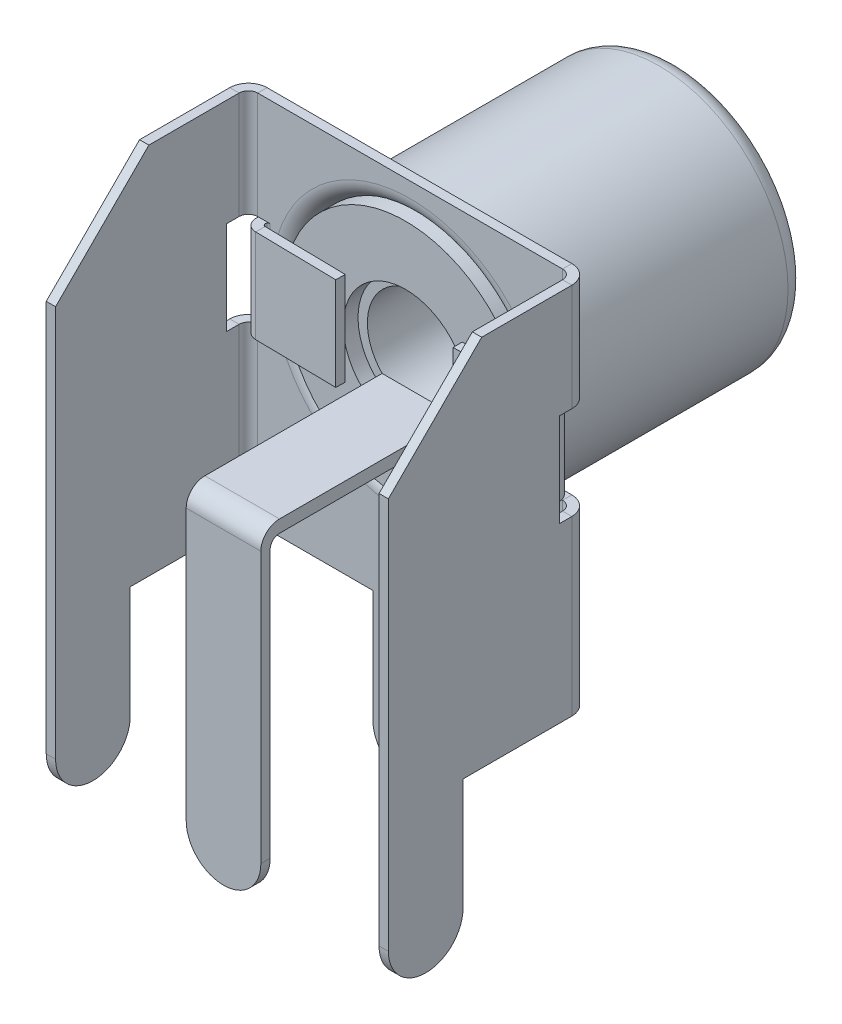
ISO-10303-21;
HEADER;
FILE_DESCRIPTION(('STEP AP214'),'2;1');
FILE_NAME('part.step','',(''),(''),'','','');
FILE_SCHEMA(('AUTOMOTIVE_DESIGN { 1 0 10303 214 1 1 1 1 }'));
ENDSEC;
DATA;
#1=APPLICATION_CONTEXT('core data for automotive mechanical design processes');
#2=APPLICATION_PROTOCOL_DEFINITION('international standard','automotive_design',2000,#1);
#3=PRODUCT_CONTEXT('',#1,'mechanical');
#4=PRODUCT('Part','Part','',(#3));
#5=PRODUCT_RELATED_PRODUCT_CATEGORY('part','',(#4));
#6=PRODUCT_DEFINITION_FORMATION('','',#4);
#7=PRODUCT_DEFINITION_CONTEXT('part definition',#1,'design');
#8=PRODUCT_DEFINITION('design','',#6,#7);
#9=PRODUCT_DEFINITION_SHAPE('','',#8);
#10=(LENGTH_UNIT() NAMED_UNIT(*) SI_UNIT(.MILLI.,.METRE.));
#11=(NAMED_UNIT(*) PLANE_ANGLE_UNIT() SI_UNIT($,.RADIAN.));
#12=(NAMED_UNIT(*) SI_UNIT($,.STERADIAN.) SOLID_ANGLE_UNIT());
#13=UNCERTAINTY_MEASURE_WITH_UNIT(LENGTH_MEASURE(1.E-05),#10,'distance_accuracy_value','');
#14=(GEOMETRIC_REPRESENTATION_CONTEXT(3) GLOBAL_UNCERTAINTY_ASSIGNED_CONTEXT((#13)) GLOBAL_UNIT_ASSIGNED_CONTEXT((#10,
#11,#12)) REPRESENTATION_CONTEXT('',''));
#15=CARTESIAN_POINT('',(0.,0.,0.));
#16=DIRECTION('',(0.,0.,1.));
#17=DIRECTION('',(1.,0.,0.));
#18=AXIS2_PLACEMENT_3D('',#15,#16,#17);
#19=CARTESIAN_POINT('',(-1.2,5.89145805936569,6.));
#20=DIRECTION('',(1.,0.,0.));
#21=DIRECTION('',(0.,1.,0.));
#22=AXIS2_PLACEMENT_3D('',#19,#20,#21);
#23=PLANE('',#22);
#24=DIRECTION('',(0.,-1.,0.));
#25=VECTOR('',#24,1.);
#26=CARTESIAN_POINT('',(-1.2,5.89145805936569,6.3));
#27=LINE('',#26,#25);
#28=CARTESIAN_POINT('',(-1.2,5.29145805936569,6.3));
#29=VERTEX_POINT('',#28);
#30=CARTESIAN_POINT('',(-1.2,-3.40854194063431,6.3));
#31=VERTEX_POINT('',#30);
#32=EDGE_CURVE('E191',#29,#31,#27,.T.);
#33=ORIENTED_EDGE('',*,*,#32,.F.);
#34=CARTESIAN_POINT('',(-1.2,5.29145805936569,5.7));
#35=DIRECTION('',(1.,0.,0.));
#36=DIRECTION('',(0.,1.,0.));
#37=AXIS2_PLACEMENT_3D('',#34,#35,#36);
#38=CIRCLE('',#37,0.6);
#39=CARTESIAN_POINT('',(-1.2,5.89145805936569,5.7));
#40=VERTEX_POINT('',#39);
#41=EDGE_CURVE('E118',#29,#40,#38,.F.);
#42=ORIENTED_EDGE('',*,*,#41,.T.);
#43=DIRECTION('',(0.,0.,-1.));
#44=VECTOR('',#43,1.);
#45=CARTESIAN_POINT('',(-1.2,5.89145805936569,6.));
#46=LINE('',#45,#44);
#47=CARTESIAN_POINT('',(-1.2,5.89145805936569,0.));
#48=VERTEX_POINT('',#47);
#49=EDGE_CURVE('E186',#40,#48,#46,.T.);
#50=ORIENTED_EDGE('',*,*,#49,.T.);
#51=DIRECTION('',(0.,-1.,0.));
#52=VECTOR('',#51,1.);
#53=CARTESIAN_POINT('',(-1.2,5.89145805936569,0.));
#54=LINE('',#53,#52);
#55=CARTESIAN_POINT('',(-1.2,5.49141970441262,0.));
#56=VERTEX_POINT('',#55);
#57=EDGE_CURVE('E182',#48,#56,#54,.T.);
#58=ORIENTED_EDGE('',*,*,#57,.T.);
#59=DIRECTION('',(0.,0.,-1.));
#60=VECTOR('',#59,1.);
#61=CARTESIAN_POINT('',(-1.2,5.49141970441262,6.));
#62=LINE('',#61,#60);
#63=CARTESIAN_POINT('',(-1.2,5.49141970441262,5.7));
#64=VERTEX_POINT('',#63);
#65=EDGE_CURVE('E165',#64,#56,#62,.T.);
#66=ORIENTED_EDGE('',*,*,#65,.F.);
#67=CARTESIAN_POINT('',(-1.2,5.19141970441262,5.7));
#68=DIRECTION('',(1.,0.,0.));
#69=DIRECTION('',(0.,1.,0.));
#70=AXIS2_PLACEMENT_3D('',#67,#68,#69);
#71=CIRCLE('',#70,0.3);
#72=CARTESIAN_POINT('',(-1.2,5.19141970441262,6.));
#73=VERTEX_POINT('',#72);
#74=EDGE_CURVE('E215',#64,#73,#71,.T.);
#75=ORIENTED_EDGE('',*,*,#74,.T.);
#76=DIRECTION('',(0.,-1.,0.));
#77=VECTOR('',#76,1.);
#78=CARTESIAN_POINT('',(-1.2,5.89145805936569,6.));
#79=LINE('',#78,#77);
#80=CARTESIAN_POINT('',(-1.2,-3.40854194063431,6.));
#81=VERTEX_POINT('',#80);
#82=EDGE_CURVE('E233',#73,#81,#79,.T.);
#83=ORIENTED_EDGE('',*,*,#82,.T.);
#84=DIRECTION('',(0.,0.,-1.));
#85=VECTOR('',#84,1.);
#86=CARTESIAN_POINT('',(-1.19999999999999,-3.40854194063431,6.));
#87=LINE('',#86,#85);
#88=EDGE_CURVE('E229',#81,#31,#87,.F.);
#89=ORIENTED_EDGE('',*,*,#88,.T.);
#90=EDGE_LOOP('',(#33,#42,#50,#58,#66,#75,#83,#89));
#91=FACE_BOUND('',#90,.T.);
#92=ADVANCED_FACE('F96',(#91),#23,.F.);
#93=CARTESIAN_POINT('',(-1.2,5.49141970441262,6.));
#94=DIRECTION('',(0.,1.,0.));
#95=DIRECTION('',(0.,0.,1.));
#96=AXIS2_PLACEMENT_3D('',#93,#94,#95);
#97=PLANE('',#96);
#98=DIRECTION('',(0.,0.,-1.));
#99=VECTOR('',#98,1.);
#100=CARTESIAN_POINT('',(1.2,5.49141970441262,6.));
#101=LINE('',#100,#99);
#102=CARTESIAN_POINT('',(1.2,5.49141970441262,5.7));
#103=VERTEX_POINT('',#102);
#104=CARTESIAN_POINT('',(1.2,5.49141970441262,0.));
#105=VERTEX_POINT('',#104);
#106=EDGE_CURVE('E176',#103,#105,#101,.T.);
#107=ORIENTED_EDGE('',*,*,#106,.F.);
#108=DIRECTION('',(1.,0.,0.));
#109=VECTOR('',#108,1.);
#110=CARTESIAN_POINT('',(-1.2,5.49141970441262,5.7));
#111=LINE('',#110,#109);
#112=EDGE_CURVE('E172',#103,#64,#111,.F.);
#113=ORIENTED_EDGE('',*,*,#112,.T.);
#114=ORIENTED_EDGE('',*,*,#65,.T.);
#115=DIRECTION('',(1.,0.,0.));
#116=VECTOR('',#115,1.);
#117=CARTESIAN_POINT('',(-1.2,5.49141970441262,0.));
#118=LINE('',#117,#116);
#119=EDGE_CURVE('E169',#56,#105,#118,.T.);
#120=ORIENTED_EDGE('',*,*,#119,.T.);
#121=EDGE_LOOP('',(#107,#113,#114,#120));
#122=FACE_BOUND('',#121,.T.);
#123=ADVANCED_FACE('F168',(#122),#97,.F.);
#124=CARTESIAN_POINT('',(1.2,5.89145805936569,6.));
#125=DIRECTION('',(-1.,0.,0.));
#126=DIRECTION('',(0.,-1.,0.));
#127=AXIS2_PLACEMENT_3D('',#124,#125,#126);
#128=PLANE('',#127);
#129=DIRECTION('',(0.,0.,-1.));
#130=VECTOR('',#129,1.);
#131=CARTESIAN_POINT('',(1.2,5.89145805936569,6.));
#132=LINE('',#131,#130);
#133=CARTESIAN_POINT('',(1.2,5.89145805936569,5.7));
#134=VERTEX_POINT('',#133);
#135=CARTESIAN_POINT('',(1.2,5.89145805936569,0.));
#136=VERTEX_POINT('',#135);
#137=EDGE_CURVE('E201',#134,#136,#132,.T.);
#138=ORIENTED_EDGE('',*,*,#137,.F.);
#139=CARTESIAN_POINT('',(1.2,5.29145805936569,5.7));
#140=DIRECTION('',(-1.,0.,0.));
#141=DIRECTION('',(0.,-1.,0.));
#142=AXIS2_PLACEMENT_3D('',#139,#140,#141);
#143=CIRCLE('',#142,0.6);
#144=CARTESIAN_POINT('',(1.2,5.29145805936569,6.3));
#145=VERTEX_POINT('',#144);
#146=EDGE_CURVE('E14',#134,#145,#143,.F.);
#147=ORIENTED_EDGE('',*,*,#146,.T.);
#148=DIRECTION('',(0.,1.,0.));
#149=VECTOR('',#148,1.);
#150=CARTESIAN_POINT('',(1.2,5.89145805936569,6.3));
#151=LINE('',#150,#149);
#152=CARTESIAN_POINT('',(1.2,-3.40854194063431,6.3));
#153=VERTEX_POINT('',#152);
#154=EDGE_CURVE('E188',#153,#145,#151,.T.);
#155=ORIENTED_EDGE('',*,*,#154,.F.);
#156=DIRECTION('',(0.,0.,-1.));
#157=VECTOR('',#156,1.);
#158=CARTESIAN_POINT('',(1.19999999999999,-3.40854194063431,6.));
#159=LINE('',#158,#157);
#160=CARTESIAN_POINT('',(1.2,-3.40854194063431,6.));
#161=VERTEX_POINT('',#160);
#162=EDGE_CURVE('E239',#153,#161,#159,.T.);
#163=ORIENTED_EDGE('',*,*,#162,.T.);
#164=DIRECTION('',(0.,1.,0.));
#165=VECTOR('',#164,1.);
#166=CARTESIAN_POINT('',(1.2,5.89145805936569,6.));
#167=LINE('',#166,#165);
#168=CARTESIAN_POINT('',(1.2,5.19141970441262,6.));
#169=VERTEX_POINT('',#168);
#170=EDGE_CURVE('E230',#161,#169,#167,.T.);
#171=ORIENTED_EDGE('',*,*,#170,.T.);
#172=CARTESIAN_POINT('',(1.2,5.19141970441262,5.7));
#173=DIRECTION('',(-1.,0.,0.));
#174=DIRECTION('',(0.,-1.,0.));
#175=AXIS2_PLACEMENT_3D('',#172,#173,#174);
#176=CIRCLE('',#175,0.3);
#177=EDGE_CURVE('E213',#169,#103,#176,.T.);
#178=ORIENTED_EDGE('',*,*,#177,.T.);
#179=ORIENTED_EDGE('',*,*,#106,.T.);
#180=DIRECTION('',(0.,1.,0.));
#181=VECTOR('',#180,1.);
#182=CARTESIAN_POINT('',(1.2,5.89145805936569,0.));
#183=LINE('',#182,#181);
#184=EDGE_CURVE('E184',#105,#136,#183,.T.);
#185=ORIENTED_EDGE('',*,*,#184,.T.);
#186=EDGE_LOOP('',(#138,#147,#155,#163,#171,#178,#179,#185));
#187=FACE_BOUND('',#186,.T.);
#188=ADVANCED_FACE('F264',(#187),#128,.F.);
#189=CARTESIAN_POINT('',(-1.2,5.89145805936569,6.));
#190=DIRECTION('',(0.,-1.,0.));
#191=DIRECTION('',(0.,0.,-1.));
#192=AXIS2_PLACEMENT_3D('',#189,#190,#191);
#193=PLANE('',#192);
#194=ORIENTED_EDGE('',*,*,#49,.F.);
#195=DIRECTION('',(-1.,0.,0.));
#196=VECTOR('',#195,1.);
#197=CARTESIAN_POINT('',(1.2,5.89145805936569,5.7));
#198=LINE('',#197,#196);
#199=EDGE_CURVE('E104',#40,#134,#198,.F.);
#200=ORIENTED_EDGE('',*,*,#199,.T.);
#201=ORIENTED_EDGE('',*,*,#137,.T.);
#202=DIRECTION('',(-1.,0.,0.));
#203=VECTOR('',#202,1.);
#204=CARTESIAN_POINT('',(-1.2,5.89145805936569,0.));
#205=LINE('',#204,#203);
#206=EDGE_CURVE('E198',#136,#48,#205,.T.);
#207=ORIENTED_EDGE('',*,*,#206,.T.);
#208=EDGE_LOOP('',(#194,#200,#201,#207));
#209=FACE_BOUND('',#208,.T.);
#210=ADVANCED_FACE('F293',(#209),#193,.F.);
#211=CARTESIAN_POINT('',(0.,0.,0.));
#212=DIRECTION('',(0.,0.,1.));
#213=DIRECTION('',(1.,0.,0.));
#214=AXIS2_PLACEMENT_3D('',#211,#212,#213);
#215=PLANE('',#214);
#216=ORIENTED_EDGE('',*,*,#57,.F.);
#217=ORIENTED_EDGE('',*,*,#206,.F.);
#218=ORIENTED_EDGE('',*,*,#184,.F.);
#219=ORIENTED_EDGE('',*,*,#119,.F.);
#220=EDGE_LOOP('',(#216,#217,#218,#219));
#221=FACE_BOUND('',#220,.T.);
#222=ADVANCED_FACE('F180',(#221),#215,.F.);
#223=CARTESIAN_POINT('',(0.,0.,6.));
#224=DIRECTION('',(0.,0.,1.));
#225=DIRECTION('',(1.,0.,0.));
#226=AXIS2_PLACEMENT_3D('',#223,#224,#225);
#227=PLANE('',#226);
#228=ORIENTED_EDGE('',*,*,#82,.F.);
#229=DIRECTION('',(1.,0.,0.));
#230=VECTOR('',#229,1.);
#231=CARTESIAN_POINT('',(1.2,5.19141970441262,6.));
#232=LINE('',#231,#230);
#233=EDGE_CURVE('E209',#73,#169,#232,.T.);
#234=ORIENTED_EDGE('',*,*,#233,.T.);
#235=ORIENTED_EDGE('',*,*,#170,.F.);
#236=CARTESIAN_POINT('',(0.,-3.40854194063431,6.));
#237=DIRECTION('',(0.,0.,1.));
#238=DIRECTION('',(1.,0.,0.));
#239=AXIS2_PLACEMENT_3D('',#236,#237,#238);
#240=CIRCLE('',#239,1.2);
#241=CARTESIAN_POINT('',(0.,-4.60854194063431,6.));
#242=VERTEX_POINT('',#241);
#243=EDGE_CURVE('E175',#161,#242,#240,.F.);
#244=ORIENTED_EDGE('',*,*,#243,.T.);
#245=CARTESIAN_POINT('',(0.,-3.40854194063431,6.));
#246=DIRECTION('',(0.,0.,1.));
#247=DIRECTION('',(1.,0.,0.));
#248=AXIS2_PLACEMENT_3D('',#245,#246,#247);
#249=CIRCLE('',#248,1.2);
#250=EDGE_CURVE('E246',#242,#81,#249,.F.);
#251=ORIENTED_EDGE('',*,*,#250,.T.);
#252=EDGE_LOOP('',(#228,#234,#235,#244,#251));
#253=FACE_BOUND('',#252,.T.);
#254=ADVANCED_FACE('F254',(#253),#227,.F.);
#255=CARTESIAN_POINT('',(0.,0.,6.3));
#256=DIRECTION('',(0.,0.,1.));
#257=DIRECTION('',(1.,0.,0.));
#258=AXIS2_PLACEMENT_3D('',#255,#256,#257);
#259=PLANE('',#258);
#260=ORIENTED_EDGE('',*,*,#154,.T.);
#261=DIRECTION('',(-1.,0.,0.));
#262=VECTOR('',#261,1.);
#263=CARTESIAN_POINT('',(-1.2,5.29145805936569,6.3));
#264=LINE('',#263,#262);
#265=EDGE_CURVE('E217',#145,#29,#264,.T.);
#266=ORIENTED_EDGE('',*,*,#265,.T.);
#267=ORIENTED_EDGE('',*,*,#32,.T.);
#268=CARTESIAN_POINT('',(0.,-3.40854194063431,6.3));
#269=DIRECTION('',(0.,0.,1.));
#270=DIRECTION('',(1.,0.,0.));
#271=AXIS2_PLACEMENT_3D('',#268,#269,#270);
#272=CIRCLE('',#271,1.2);
#273=CARTESIAN_POINT('',(0.,-4.60854194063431,6.3));
#274=VERTEX_POINT('',#273);
#275=EDGE_CURVE('E241',#31,#274,#272,.T.);
#276=ORIENTED_EDGE('',*,*,#275,.T.);
#277=CARTESIAN_POINT('',(0.,-3.40854194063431,6.3));
#278=DIRECTION('',(0.,0.,1.));
#279=DIRECTION('',(1.,0.,0.));
#280=AXIS2_PLACEMENT_3D('',#277,#278,#279);
#281=CIRCLE('',#280,1.2);
#282=EDGE_CURVE('E243',#274,#153,#281,.T.);
#283=ORIENTED_EDGE('',*,*,#282,.T.);
#284=EDGE_LOOP('',(#260,#266,#267,#276,#283));
#285=FACE_BOUND('',#284,.T.);
#286=ADVANCED_FACE('F222',(#285),#259,.T.);
#287=CARTESIAN_POINT('',(0.,-3.40854194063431,6.));
#288=DIRECTION('',(0.,0.,-1.));
#289=DIRECTION('',(-1.,0.,0.));
#290=AXIS2_PLACEMENT_3D('',#287,#288,#289);
#291=CYLINDRICAL_SURFACE('',#290,1.2);
#292=ORIENTED_EDGE('',*,*,#162,.F.);
#293=ORIENTED_EDGE('',*,*,#282,.F.);
#294=DIRECTION('',(0.,0.,-1.));
#295=VECTOR('',#294,1.);
#296=CARTESIAN_POINT('',(0.,-4.60854194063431,6.3));
#297=LINE('',#296,#295);
#298=EDGE_CURVE('E236',#242,#274,#297,.F.);
#299=ORIENTED_EDGE('',*,*,#298,.F.);
#300=ORIENTED_EDGE('',*,*,#243,.F.);
#301=EDGE_LOOP('',(#292,#293,#299,#300));
#302=FACE_BOUND('',#301,.T.);
#303=ADVANCED_FACE('F260',(#302),#291,.T.);
#304=CARTESIAN_POINT('',(0.,-3.40854194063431,6.3));
#305=DIRECTION('',(0.,0.,-1.));
#306=DIRECTION('',(-1.,0.,0.));
#307=AXIS2_PLACEMENT_3D('',#304,#305,#306);
#308=CYLINDRICAL_SURFACE('',#307,1.2);
#309=ORIENTED_EDGE('',*,*,#275,.F.);
#310=ORIENTED_EDGE('',*,*,#88,.F.);
#311=ORIENTED_EDGE('',*,*,#250,.F.);
#312=ORIENTED_EDGE('',*,*,#298,.T.);
#313=EDGE_LOOP('',(#309,#310,#311,#312));
#314=FACE_BOUND('',#313,.T.);
#315=ADVANCED_FACE('F262',(#314),#308,.T.);
#316=CARTESIAN_POINT('',(0.,5.19141970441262,5.7));
#317=DIRECTION('',(-1.,0.,0.));
#318=DIRECTION('',(0.,0.,1.));
#319=AXIS2_PLACEMENT_3D('',#316,#317,#318);
#320=CYLINDRICAL_SURFACE('',#319,0.3);
#321=ORIENTED_EDGE('',*,*,#74,.F.);
#322=ORIENTED_EDGE('',*,*,#112,.F.);
#323=ORIENTED_EDGE('',*,*,#177,.F.);
#324=ORIENTED_EDGE('',*,*,#233,.F.);
#325=EDGE_LOOP('',(#321,#322,#323,#324));
#326=FACE_BOUND('',#325,.T.);
#327=ADVANCED_FACE('F266',(#326),#320,.F.);
#328=CARTESIAN_POINT('',(0.,5.29145805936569,5.7));
#329=DIRECTION('',(1.,0.,0.));
#330=DIRECTION('',(0.,0.,-1.));
#331=AXIS2_PLACEMENT_3D('',#328,#329,#330);
#332=CYLINDRICAL_SURFACE('',#331,0.6);
#333=ORIENTED_EDGE('',*,*,#146,.F.);
#334=ORIENTED_EDGE('',*,*,#199,.F.);
#335=ORIENTED_EDGE('',*,*,#41,.F.);
#336=ORIENTED_EDGE('',*,*,#265,.F.);
#337=EDGE_LOOP('',(#333,#334,#335,#336));
#338=FACE_BOUND('',#337,.T.);
#339=ADVANCED_FACE('F98',(#338),#332,.T.);
#340=CLOSED_SHELL('',(#92,#123,#188,#210,#222,#254,#286,#303,#315,#327,#339));
#341=MANIFOLD_SOLID_BREP('B2',#340);
#342=CARTESIAN_POINT('',(0.,7.06005764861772,-7.5));
#343=DIRECTION('',(0.,0.,1.));
#344=DIRECTION('',(1.,0.,0.));
#345=AXIS2_PLACEMENT_3D('',#342,#343,#344);
#346=CYLINDRICAL_SURFACE('',#345,1.675);
#347=CARTESIAN_POINT('',(0.,7.06005764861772,0.));
#348=DIRECTION('',(0.,0.,-1.));
#349=DIRECTION('',(1.,0.,0.));
#350=AXIS2_PLACEMENT_3D('',#347,#348,#349);
#351=CIRCLE('',#350,1.675);
#352=CARTESIAN_POINT('',(0.25,8.71629585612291,0.));
#353=VERTEX_POINT('',#352);
#354=CARTESIAN_POINT('',(-0.25,8.71629585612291,0.));
#355=VERTEX_POINT('',#354);
#356=EDGE_CURVE('E440',#353,#355,#351,.T.);
#357=ORIENTED_EDGE('',*,*,#356,.F.);
#358=DIRECTION('',(0.,0.,1.));
#359=VECTOR('',#358,1.);
#360=CARTESIAN_POINT('',(0.25,8.71629585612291,-7.5));
#361=LINE('',#360,#359);
#362=CARTESIAN_POINT('',(0.25,8.71629585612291,-7.5));
#363=VERTEX_POINT('',#362);
#364=EDGE_CURVE('E94',#363,#353,#361,.T.);
#365=ORIENTED_EDGE('',*,*,#364,.F.);
#366=CARTESIAN_POINT('',(0.,7.06005764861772,-7.5));
#367=DIRECTION('',(0.,0.,-1.));
#368=DIRECTION('',(1.,0.,0.));
#369=AXIS2_PLACEMENT_3D('',#366,#367,#368);
#370=CIRCLE('',#369,1.675);
#371=CARTESIAN_POINT('',(-0.25,8.71629585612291,-7.5));
#372=VERTEX_POINT('',#371);
#373=EDGE_CURVE('E434',#363,#372,#370,.T.);
#374=ORIENTED_EDGE('',*,*,#373,.T.);
#375=DIRECTION('',(0.,0.,1.));
#376=VECTOR('',#375,1.);
#377=CARTESIAN_POINT('',(-0.25,8.71629585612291,-7.5));
#378=LINE('',#377,#376);
#379=EDGE_CURVE('E379',#372,#355,#378,.T.);
#380=ORIENTED_EDGE('',*,*,#379,.T.);
#381=EDGE_LOOP('',(#357,#365,#374,#380));
#382=FACE_BOUND('',#381,.T.);
#383=ADVANCED_FACE('F376',(#382),#346,.F.);
#384=CARTESIAN_POINT('',(0.25,9.01917096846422,-7.5));
#385=DIRECTION('',(-1.,0.,0.));
#386=DIRECTION('',(0.,-1.,0.));
#387=AXIS2_PLACEMENT_3D('',#384,#385,#386);
#388=PLANE('',#387);
#389=DIRECTION('',(0.,-1.,0.));
#390=VECTOR('',#389,1.);
#391=CARTESIAN_POINT('',(0.25,9.01917096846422,0.));
#392=LINE('',#391,#390);
#393=CARTESIAN_POINT('',(0.25,9.01917096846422,0.));
#394=VERTEX_POINT('',#393);
#395=EDGE_CURVE('E436',#394,#353,#392,.T.);
#396=ORIENTED_EDGE('',*,*,#395,.F.);
#397=DIRECTION('',(0.,0.,1.));
#398=VECTOR('',#397,1.);
#399=CARTESIAN_POINT('',(0.25,9.01917096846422,-7.5));
#400=LINE('',#399,#398);
#401=CARTESIAN_POINT('',(0.25,9.01917096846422,-7.5));
#402=VERTEX_POINT('',#401);
#403=EDGE_CURVE('E385',#402,#394,#400,.T.);
#404=ORIENTED_EDGE('',*,*,#403,.F.);
#405=DIRECTION('',(0.,-1.,0.));
#406=VECTOR('',#405,1.);
#407=CARTESIAN_POINT('',(0.25,9.01917096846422,-7.5));
#408=LINE('',#407,#406);
#409=EDGE_CURVE('E431',#402,#363,#408,.T.);
#410=ORIENTED_EDGE('',*,*,#409,.T.);
#411=ORIENTED_EDGE('',*,*,#364,.T.);
#412=EDGE_LOOP('',(#396,#404,#410,#411));
#413=FACE_BOUND('',#412,.T.);
#414=ADVANCED_FACE('F450',(#413),#388,.T.);
#415=CARTESIAN_POINT('',(0.,7.06005764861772,-7.5));
#416=DIRECTION('',(0.,0.,1.));
#417=DIRECTION('',(1.,0.,0.));
#418=AXIS2_PLACEMENT_3D('',#415,#416,#417);
#419=CYLINDRICAL_SURFACE('',#418,1.975);
#420=CARTESIAN_POINT('',(0.,7.06005764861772,0.));
#421=DIRECTION('',(0.,0.,1.));
#422=DIRECTION('',(1.,0.,0.));
#423=AXIS2_PLACEMENT_3D('',#420,#421,#422);
#424=CIRCLE('',#423,1.975);
#425=CARTESIAN_POINT('',(-0.25,9.01917096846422,0.));
#426=VERTEX_POINT('',#425);
#427=EDGE_CURVE('E426',#426,#394,#424,.T.);
#428=ORIENTED_EDGE('',*,*,#427,.F.);
#429=DIRECTION('',(0.,0.,1.));
#430=VECTOR('',#429,1.);
#431=CARTESIAN_POINT('',(-0.25,9.01917096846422,-7.5));
#432=LINE('',#431,#430);
#433=CARTESIAN_POINT('',(-0.25,9.01917096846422,-7.5));
#434=VERTEX_POINT('',#433);
#435=EDGE_CURVE('E421',#434,#426,#432,.T.);
#436=ORIENTED_EDGE('',*,*,#435,.F.);
#437=CARTESIAN_POINT('',(0.,7.06005764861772,-7.5));
#438=DIRECTION('',(0.,0.,1.));
#439=DIRECTION('',(1.,0.,0.));
#440=AXIS2_PLACEMENT_3D('',#437,#438,#439);
#441=CIRCLE('',#440,1.975);
#442=EDGE_CURVE('E424',#434,#402,#441,.T.);
#443=ORIENTED_EDGE('',*,*,#442,.T.);
#444=ORIENTED_EDGE('',*,*,#403,.T.);
#445=EDGE_LOOP('',(#428,#436,#443,#444));
#446=FACE_BOUND('',#445,.T.);
#447=ADVANCED_FACE('F423',(#446),#419,.T.);
#448=CARTESIAN_POINT('',(-0.25,9.01917096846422,-7.5));
#449=DIRECTION('',(1.,0.,0.));
#450=DIRECTION('',(0.,0.,-1.));
#451=AXIS2_PLACEMENT_3D('',#448,#449,#450);
#452=PLANE('',#451);
#453=DIRECTION('',(0.,1.,0.));
#454=VECTOR('',#453,1.);
#455=CARTESIAN_POINT('',(-0.25,9.01917096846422,0.));
#456=LINE('',#455,#454);
#457=EDGE_CURVE('E443',#355,#426,#456,.T.);
#458=ORIENTED_EDGE('',*,*,#457,.F.);
#459=ORIENTED_EDGE('',*,*,#379,.F.);
#460=DIRECTION('',(0.,1.,0.));
#461=VECTOR('',#460,1.);
#462=CARTESIAN_POINT('',(-0.25,9.01917096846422,-7.5));
#463=LINE('',#462,#461);
#464=EDGE_CURVE('E430',#372,#434,#463,.T.);
#465=ORIENTED_EDGE('',*,*,#464,.T.);
#466=ORIENTED_EDGE('',*,*,#435,.T.);
#467=EDGE_LOOP('',(#458,#459,#465,#466));
#468=FACE_BOUND('',#467,.T.);
#469=ADVANCED_FACE('F433',(#468),#452,.T.);
#470=CARTESIAN_POINT('',(0.,7.06005764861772,-7.5));
#471=DIRECTION('',(0.,0.,1.));
#472=DIRECTION('',(1.,0.,0.));
#473=AXIS2_PLACEMENT_3D('',#470,#471,#472);
#474=PLANE('',#473);
#475=ORIENTED_EDGE('',*,*,#373,.F.);
#476=ORIENTED_EDGE('',*,*,#409,.F.);
#477=ORIENTED_EDGE('',*,*,#442,.F.);
#478=ORIENTED_EDGE('',*,*,#464,.F.);
#479=EDGE_LOOP('',(#475,#476,#477,#478));
#480=FACE_BOUND('',#479,.T.);
#481=ADVANCED_FACE('F429',(#480),#474,.F.);
#482=CARTESIAN_POINT('',(0.,7.06005764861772,0.));
#483=DIRECTION('',(0.,0.,1.));
#484=DIRECTION('',(1.,0.,0.));
#485=AXIS2_PLACEMENT_3D('',#482,#483,#484);
#486=PLANE('',#485);
#487=ORIENTED_EDGE('',*,*,#356,.T.);
#488=ORIENTED_EDGE('',*,*,#457,.T.);
#489=ORIENTED_EDGE('',*,*,#427,.T.);
#490=ORIENTED_EDGE('',*,*,#395,.T.);
#491=EDGE_LOOP('',(#487,#488,#489,#490));
#492=FACE_BOUND('',#491,.T.);
#493=ADVANCED_FACE('F449',(#492),#486,.T.);
#494=CLOSED_SHELL('',(#383,#414,#447,#469,#481,#493));
#495=MANIFOLD_SOLID_BREP('B8',#494);
#496=CARTESIAN_POINT('',(0.,7.06005764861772,-0.3));
#497=DIRECTION('',(0.,0.,-1.));
#498=DIRECTION('',(-1.,0.,0.));
#499=AXIS2_PLACEMENT_3D('',#496,#497,#498);
#500=TOROIDAL_SURFACE('',#499,4.45,0.6);
#501=CARTESIAN_POINT('',(0.,7.06005764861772,0.3));
#502=DIRECTION('',(0.,0.,-1.));
#503=DIRECTION('',(-1.,0.,0.));
#504=AXIS2_PLACEMENT_3D('',#501,#502,#503);
#505=CIRCLE('',#504,4.45);
#506=CARTESIAN_POINT('',(-4.45,7.06005764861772,0.3));
#507=VERTEX_POINT('',#506);
#508=EDGE_CURVE('E1203',#507,#507,#505,.T.);
#509=ORIENTED_EDGE('',*,*,#508,.F.);
#510=EDGE_LOOP('',(#509));
#511=FACE_BOUND('',#510,.T.);
#512=CARTESIAN_POINT('',(0.,7.06005764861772,-0.0602084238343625));
#513=DIRECTION('',(0.,0.,-1.));
#514=DIRECTION('',(-1.,0.,0.));
#515=AXIS2_PLACEMENT_3D('',#512,#513,#514);
#516=CIRCLE('',#515,3.9);
#517=CARTESIAN_POINT('',(-3.9,7.06005764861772,-0.0602084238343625));
#518=VERTEX_POINT('',#517);
#519=EDGE_CURVE('E504',#518,#518,#516,.T.);
#520=ORIENTED_EDGE('',*,*,#519,.T.);
#521=EDGE_LOOP('',(#520));
#522=FACE_BOUND('',#521,.T.);
#523=ADVANCED_FACE('F500',(#511,#522),#500,.T.);
#524=CARTESIAN_POINT('',(0.,7.06005764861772,-7.7));
#525=DIRECTION('',(0.,0.,-1.));
#526=DIRECTION('',(-1.,0.,0.));
#527=AXIS2_PLACEMENT_3D('',#524,#525,#526);
#528=TOROIDAL_SURFACE('',#527,3.55,0.3);
#529=CARTESIAN_POINT('',(0.,7.06005764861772,-8.));
#530=DIRECTION('',(0.,0.,-1.));
#531=DIRECTION('',(-1.,0.,0.));
#532=AXIS2_PLACEMENT_3D('',#529,#530,#531);
#533=CIRCLE('',#532,3.55);
#534=CARTESIAN_POINT('',(-3.55,7.06005764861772,-8.));
#535=VERTEX_POINT('',#534);
#536=EDGE_CURVE('E1212',#535,#535,#533,.F.);
#537=ORIENTED_EDGE('',*,*,#536,.F.);
#538=EDGE_LOOP('',(#537));
#539=FACE_BOUND('',#538,.T.);
#540=CARTESIAN_POINT('',(0.,7.06005764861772,-7.75148353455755));
#541=DIRECTION('',(0.,0.,1.));
#542=DIRECTION('',(0.,-1.,0.));
#543=AXIS2_PLACEMENT_3D('',#540,#541,#542);
#544=CIRCLE('',#543,3.84554939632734);
#545=CARTESIAN_POINT('',(0.,3.21450825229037,-7.75148353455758));
#546=VERTEX_POINT('',#545);
#547=EDGE_CURVE('E374',#546,#546,#544,.F.);
#548=ORIENTED_EDGE('',*,*,#547,.F.);
#549=EDGE_LOOP('',(#548));
#550=FACE_BOUND('',#549,.T.);
#551=ADVANCED_FACE('F1320',(#539,#550),#528,.F.);
#552=CARTESIAN_POINT('',(4.9,0.,0.6));
#553=DIRECTION('',(0.,1.,0.));
#554=DIRECTION('',(1.,0.,0.));
#555=AXIS2_PLACEMENT_3D('',#552,#553,#554);
#556=PLANE('',#555);
#557=DIRECTION('',(1.,0.,0.));
#558=VECTOR('',#557,1.);
#559=CARTESIAN_POINT('',(5.2,0.,4.1));
#560=LINE('',#559,#558);
#561=CARTESIAN_POINT('',(5.2,0.,4.1));
#562=VERTEX_POINT('',#561);
#563=CARTESIAN_POINT('',(5.5,0.,4.1));
#564=VERTEX_POINT('',#563);
#565=EDGE_CURVE('E930',#562,#564,#560,.T.);
#566=ORIENTED_EDGE('',*,*,#565,.F.);
#567=DIRECTION('',(0.,0.,1.));
#568=VECTOR('',#567,1.);
#569=CARTESIAN_POINT('',(5.2,0.,0.));
#570=LINE('',#569,#568);
#571=CARTESIAN_POINT('',(5.2,0.,0.599999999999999));
#572=VERTEX_POINT('',#571);
#573=EDGE_CURVE('E1055',#572,#562,#570,.T.);
#574=ORIENTED_EDGE('',*,*,#573,.F.);
#575=DIRECTION('',(1.,0.,0.));
#576=VECTOR('',#575,1.);
#577=CARTESIAN_POINT('',(5.2,0.,0.599999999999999));
#578=LINE('',#577,#576);
#579=CARTESIAN_POINT('',(5.5,0.,0.599999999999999));
#580=VERTEX_POINT('',#579);
#581=EDGE_CURVE('E1158',#572,#580,#578,.T.);
#582=ORIENTED_EDGE('',*,*,#581,.T.);
#583=DIRECTION('',(0.,0.,1.));
#584=VECTOR('',#583,1.);
#585=CARTESIAN_POINT('',(5.5,0.,0.));
#586=LINE('',#585,#584);
#587=EDGE_CURVE('E1090',#580,#564,#586,.T.);
#588=ORIENTED_EDGE('',*,*,#587,.T.);
#589=EDGE_LOOP('',(#566,#574,#582,#588));
#590=FACE_BOUND('',#589,.T.);
#591=ADVANCED_FACE('F1326',(#590),#556,.F.);
#592=CARTESIAN_POINT('',(-4.9,0.,0.3));
#593=DIRECTION('',(0.,-1.,0.));
#594=DIRECTION('',(0.,0.,-1.));
#595=AXIS2_PLACEMENT_3D('',#592,#593,#594);
#596=PLANE('',#595);
#597=DIRECTION('',(0.,0.,-1.));
#598=VECTOR('',#597,1.);
#599=CARTESIAN_POINT('',(-5.2,0.,6.5));
#600=LINE('',#599,#598);
#601=CARTESIAN_POINT('',(-5.2,0.,4.1));
#602=VERTEX_POINT('',#601);
#603=CARTESIAN_POINT('',(-5.2,0.,0.600000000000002));
#604=VERTEX_POINT('',#603);
#605=EDGE_CURVE('E1105',#602,#604,#600,.T.);
#606=ORIENTED_EDGE('',*,*,#605,.F.);
#607=DIRECTION('',(1.,0.,0.));
#608=VECTOR('',#607,1.);
#609=CARTESIAN_POINT('',(-5.5,0.,4.1));
#610=LINE('',#609,#608);
#611=CARTESIAN_POINT('',(-5.5,0.,4.1));
#612=VERTEX_POINT('',#611);
#613=EDGE_CURVE('E938',#612,#602,#610,.T.);
#614=ORIENTED_EDGE('',*,*,#613,.F.);
#615=DIRECTION('',(0.,0.,-1.));
#616=VECTOR('',#615,1.);
#617=CARTESIAN_POINT('',(-5.5,0.,6.5));
#618=LINE('',#617,#616);
#619=CARTESIAN_POINT('',(-5.5,0.,0.600000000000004));
#620=VERTEX_POINT('',#619);
#621=EDGE_CURVE('E1103',#612,#620,#618,.T.);
#622=ORIENTED_EDGE('',*,*,#621,.T.);
#623=DIRECTION('',(1.,0.,0.));
#624=VECTOR('',#623,1.);
#625=CARTESIAN_POINT('',(-5.5,0.,0.600000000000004));
#626=LINE('',#625,#624);
#627=EDGE_CURVE('E1171',#620,#604,#626,.T.);
#628=ORIENTED_EDGE('',*,*,#627,.T.);
#629=EDGE_LOOP('',(#606,#614,#622,#628));
#630=FACE_BOUND('',#629,.T.);
#631=ADVANCED_FACE('F1380',(#630),#596,.T.);
#632=CARTESIAN_POINT('',(5.2,0.,0.599999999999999));
#633=DIRECTION('',(0.,-1.,0.));
#634=DIRECTION('',(0.,0.,-1.));
#635=AXIS2_PLACEMENT_3D('',#632,#633,#634);
#636=PLANE('',#635);
#637=DIRECTION('',(1.,0.,0.));
#638=VECTOR('',#637,1.);
#639=CARTESIAN_POINT('',(-5.5,0.,0.));
#640=LINE('',#639,#638);
#641=CARTESIAN_POINT('',(-4.9,0.,0.));
#642=VERTEX_POINT('',#641);
#643=CARTESIAN_POINT('',(-1.2,0.,0.));
#644=VERTEX_POINT('',#643);
#645=EDGE_CURVE('E1097',#642,#644,#640,.T.);
#646=ORIENTED_EDGE('',*,*,#645,.T.);
#647=DIRECTION('',(0.,0.,-1.));
#648=VECTOR('',#647,1.);
#649=CARTESIAN_POINT('',(-1.2,0.,0.3));
#650=LINE('',#649,#648);
#651=CARTESIAN_POINT('',(-1.2,0.,0.3));
#652=VERTEX_POINT('',#651);
#653=EDGE_CURVE('E945',#652,#644,#650,.T.);
#654=ORIENTED_EDGE('',*,*,#653,.F.);
#655=DIRECTION('',(1.,0.,0.));
#656=VECTOR('',#655,1.);
#657=CARTESIAN_POINT('',(-5.5,0.,0.3));
#658=LINE('',#657,#656);
#659=CARTESIAN_POINT('',(-4.9,0.,0.3));
#660=VERTEX_POINT('',#659);
#661=EDGE_CURVE('E1111',#660,#652,#658,.T.);
#662=ORIENTED_EDGE('',*,*,#661,.F.);
#663=DIRECTION('',(0.,0.,-1.));
#664=VECTOR('',#663,1.);
#665=CARTESIAN_POINT('',(-4.9,0.,0.3));
#666=LINE('',#665,#664);
#667=EDGE_CURVE('E1168',#660,#642,#666,.T.);
#668=ORIENTED_EDGE('',*,*,#667,.T.);
#669=EDGE_LOOP('',(#646,#654,#662,#668));
#670=FACE_BOUND('',#669,.T.);
#671=ADVANCED_FACE('F1417',(#670),#636,.T.);
#672=CARTESIAN_POINT('',(1.2,0.,0.3));
#673=VERTEX_POINT('',#672);
#674=CARTESIAN_POINT('',(4.9,0.,0.3));
#675=VERTEX_POINT('',#674);
#676=EDGE_CURVE('E1110',#673,#675,#658,.T.);
#677=ORIENTED_EDGE('',*,*,#676,.F.);
#678=DIRECTION('',(0.,0.,1.));
#679=VECTOR('',#678,1.);
#680=CARTESIAN_POINT('',(1.2,0.,0.3));
#681=LINE('',#680,#679);
#682=CARTESIAN_POINT('',(1.2,0.,0.));
#683=VERTEX_POINT('',#682);
#684=EDGE_CURVE('E948',#683,#673,#681,.T.);
#685=ORIENTED_EDGE('',*,*,#684,.F.);
#686=CARTESIAN_POINT('',(4.9,0.,0.));
#687=VERTEX_POINT('',#686);
#688=EDGE_CURVE('E1096',#683,#687,#640,.T.);
#689=ORIENTED_EDGE('',*,*,#688,.T.);
#690=DIRECTION('',(0.,0.,1.));
#691=VECTOR('',#690,1.);
#692=CARTESIAN_POINT('',(4.9,0.,0.));
#693=LINE('',#692,#691);
#694=EDGE_CURVE('E1161',#687,#675,#693,.T.);
#695=ORIENTED_EDGE('',*,*,#694,.T.);
#696=EDGE_LOOP('',(#677,#685,#689,#695));
#697=FACE_BOUND('',#696,.T.);
#698=ADVANCED_FACE('F1433',(#697),#636,.T.);
#699=CARTESIAN_POINT('',(4.5,8.56005764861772,-0.6));
#700=DIRECTION('',(0.,-1.,0.));
#701=DIRECTION('',(0.,0.,-1.));
#702=AXIS2_PLACEMENT_3D('',#699,#700,#701);
#703=PLANE('',#702);
#704=DIRECTION('',(0.,0.,-1.));
#705=VECTOR('',#704,1.);
#706=CARTESIAN_POINT('',(5.2,8.56005764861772,0.));
#707=LINE('',#706,#705);
#708=CARTESIAN_POINT('',(5.2,8.56005764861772,1.));
#709=VERTEX_POINT('',#708);
#710=CARTESIAN_POINT('',(5.2,8.56005764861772,0.599999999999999));
#711=VERTEX_POINT('',#710);
#712=EDGE_CURVE('E981',#709,#711,#707,.T.);
#713=ORIENTED_EDGE('',*,*,#712,.T.);
#714=DIRECTION('',(1.,0.,0.));
#715=VECTOR('',#714,1.);
#716=CARTESIAN_POINT('',(5.2,8.56005764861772,0.599999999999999));
#717=LINE('',#716,#715);
#718=CARTESIAN_POINT('',(5.5,8.56005764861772,0.599999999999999));
#719=VERTEX_POINT('',#718);
#720=EDGE_CURVE('E1248',#711,#719,#717,.T.);
#721=ORIENTED_EDGE('',*,*,#720,.T.);
#722=DIRECTION('',(0.,0.,-1.));
#723=VECTOR('',#722,1.);
#724=CARTESIAN_POINT('',(5.5,8.56005764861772,-0.6));
#725=LINE('',#724,#723);
#726=CARTESIAN_POINT('',(5.5,8.56005764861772,1.));
#727=VERTEX_POINT('',#726);
#728=EDGE_CURVE('E959',#727,#719,#725,.T.);
#729=ORIENTED_EDGE('',*,*,#728,.F.);
#730=DIRECTION('',(1.,0.,0.));
#731=VECTOR('',#730,1.);
#732=CARTESIAN_POINT('',(4.5,8.56005764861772,1.));
#733=LINE('',#732,#731);
#734=EDGE_CURVE('E967',#709,#727,#733,.T.);
#735=ORIENTED_EDGE('',*,*,#734,.F.);
#736=EDGE_LOOP('',(#713,#721,#729,#735));
#737=FACE_BOUND('',#736,.T.);
#738=ADVANCED_FACE('F1576',(#737),#703,.T.);
#739=DIRECTION('',(-1.,0.,0.));
#740=VECTOR('',#739,1.);
#741=CARTESIAN_POINT('',(-5.5,8.56005764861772,0.));
#742=LINE('',#741,#740);
#743=CARTESIAN_POINT('',(4.9,8.56005764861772,0.));
#744=VERTEX_POINT('',#743);
#745=CARTESIAN_POINT('',(4.5,8.56005764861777,4.60189612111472E-13));
#746=VERTEX_POINT('',#745);
#747=EDGE_CURVE('E987',#744,#746,#742,.T.);
#748=ORIENTED_EDGE('',*,*,#747,.F.);
#749=DIRECTION('',(0.,0.,1.));
#750=VECTOR('',#749,1.);
#751=CARTESIAN_POINT('',(4.9,8.56005764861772,0.));
#752=LINE('',#751,#750);
#753=CARTESIAN_POINT('',(4.9,8.56005764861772,0.3));
#754=VERTEX_POINT('',#753);
#755=EDGE_CURVE('E1246',#744,#754,#752,.T.);
#756=ORIENTED_EDGE('',*,*,#755,.T.);
#757=DIRECTION('',(-1.,0.,0.));
#758=VECTOR('',#757,1.);
#759=CARTESIAN_POINT('',(-5.5,8.56005764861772,0.3));
#760=LINE('',#759,#758);
#761=CARTESIAN_POINT('',(4.5,8.56005764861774,0.30000000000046));
#762=VERTEX_POINT('',#761);
#763=EDGE_CURVE('E977',#754,#762,#760,.T.);
#764=ORIENTED_EDGE('',*,*,#763,.T.);
#765=DIRECTION('',(0.,0.,-1.));
#766=VECTOR('',#765,1.);
#767=CARTESIAN_POINT('',(4.5,8.56005764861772,-0.6));
#768=LINE('',#767,#766);
#769=EDGE_CURVE('E960',#762,#746,#768,.T.);
#770=ORIENTED_EDGE('',*,*,#769,.T.);
#771=EDGE_LOOP('',(#748,#756,#764,#770));
#772=FACE_BOUND('',#771,.T.);
#773=ADVANCED_FACE('F1577',(#772),#703,.T.);
#774=CARTESIAN_POINT('',(4.5,5.56005764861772,-0.6));
#775=DIRECTION('',(0.,1.,0.));
#776=DIRECTION('',(0.,0.,1.));
#777=AXIS2_PLACEMENT_3D('',#774,#775,#776);
#778=PLANE('',#777);
#779=DIRECTION('',(0.,0.,1.));
#780=VECTOR('',#779,1.);
#781=CARTESIAN_POINT('',(5.5,5.56005764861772,-0.6));
#782=LINE('',#781,#780);
#783=CARTESIAN_POINT('',(5.5,5.56005764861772,0.599999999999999));
#784=VERTEX_POINT('',#783);
#785=CARTESIAN_POINT('',(5.5,5.56005764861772,1.));
#786=VERTEX_POINT('',#785);
#787=EDGE_CURVE('E964',#784,#786,#782,.T.);
#788=ORIENTED_EDGE('',*,*,#787,.F.);
#789=DIRECTION('',(-1.,0.,0.));
#790=VECTOR('',#789,1.);
#791=CARTESIAN_POINT('',(5.5,5.56005764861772,0.599999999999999));
#792=LINE('',#791,#790);
#793=CARTESIAN_POINT('',(5.2,5.56005764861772,0.599999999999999));
#794=VERTEX_POINT('',#793);
#795=EDGE_CURVE('E1244',#784,#794,#792,.T.);
#796=ORIENTED_EDGE('',*,*,#795,.T.);
#797=DIRECTION('',(0.,0.,1.));
#798=VECTOR('',#797,1.);
#799=CARTESIAN_POINT('',(5.2,5.56005764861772,0.));
#800=LINE('',#799,#798);
#801=CARTESIAN_POINT('',(5.2,5.56005764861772,1.));
#802=VERTEX_POINT('',#801);
#803=EDGE_CURVE('E993',#794,#802,#800,.T.);
#804=ORIENTED_EDGE('',*,*,#803,.T.);
#805=DIRECTION('',(1.,0.,0.));
#806=VECTOR('',#805,1.);
#807=CARTESIAN_POINT('',(4.5,5.56005764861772,1.));
#808=LINE('',#807,#806);
#809=EDGE_CURVE('E975',#802,#786,#808,.T.);
#810=ORIENTED_EDGE('',*,*,#809,.T.);
#811=EDGE_LOOP('',(#788,#796,#804,#810));
#812=FACE_BOUND('',#811,.T.);
#813=ADVANCED_FACE('F1456',(#812),#778,.T.);
#814=DIRECTION('',(1.,0.,0.));
#815=VECTOR('',#814,1.);
#816=CARTESIAN_POINT('',(-5.5,5.56005764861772,0.3));
#817=LINE('',#816,#815);
#818=CARTESIAN_POINT('',(4.5,5.56005764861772,0.300000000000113));
#819=VERTEX_POINT('',#818);
#820=CARTESIAN_POINT('',(4.9,5.56005764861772,0.3));
#821=VERTEX_POINT('',#820);
#822=EDGE_CURVE('E990',#819,#821,#817,.T.);
#823=ORIENTED_EDGE('',*,*,#822,.T.);
#824=DIRECTION('',(0.,0.,-1.));
#825=VECTOR('',#824,1.);
#826=CARTESIAN_POINT('',(4.9,5.56005764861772,0.3));
#827=LINE('',#826,#825);
#828=CARTESIAN_POINT('',(4.9,5.56005764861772,0.));
#829=VERTEX_POINT('',#828);
#830=EDGE_CURVE('E1242',#821,#829,#827,.T.);
#831=ORIENTED_EDGE('',*,*,#830,.T.);
#832=DIRECTION('',(1.,0.,0.));
#833=VECTOR('',#832,1.);
#834=CARTESIAN_POINT('',(-5.5,5.56005764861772,0.));
#835=LINE('',#834,#833);
#836=CARTESIAN_POINT('',(4.5,5.56005764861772,0.));
#837=VERTEX_POINT('',#836);
#838=EDGE_CURVE('E998',#837,#829,#835,.T.);
#839=ORIENTED_EDGE('',*,*,#838,.F.);
#840=DIRECTION('',(0.,0.,1.));
#841=VECTOR('',#840,1.);
#842=CARTESIAN_POINT('',(4.5,5.56005764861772,-0.6));
#843=LINE('',#842,#841);
#844=EDGE_CURVE('E963',#837,#819,#843,.T.);
#845=ORIENTED_EDGE('',*,*,#844,.T.);
#846=EDGE_LOOP('',(#823,#831,#839,#845));
#847=FACE_BOUND('',#846,.T.);
#848=ADVANCED_FACE('F1473',(#847),#778,.T.);
#849=CARTESIAN_POINT('',(-5.5,12.,0.));
#850=DIRECTION('',(0.,0.,-1.));
#851=DIRECTION('',(-1.,0.,0.));
#852=AXIS2_PLACEMENT_3D('',#849,#850,#851);
#853=PLANE('',#852);
#854=CARTESIAN_POINT('',(0.,7.06005764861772,0.));
#855=DIRECTION('',(0.,0.,-1.));
#856=DIRECTION('',(-1.,0.,0.));
#857=AXIS2_PLACEMENT_3D('',#854,#855,#856);
#858=CIRCLE('',#857,4.45);
#859=CARTESIAN_POINT('',(-4.45,7.06005764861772,0.));
#860=VERTEX_POINT('',#859);
#861=EDGE_CURVE('E1200',#860,#860,#858,.F.);
#862=ORIENTED_EDGE('',*,*,#861,.T.);
#863=EDGE_LOOP('',(#862));
#864=FACE_BOUND('',#863,.T.);
#865=DIRECTION('',(0.,1.,0.));
#866=VECTOR('',#865,1.);
#867=CARTESIAN_POINT('',(1.2,-4.8,0.));
#868=LINE('',#867,#866);
#869=CARTESIAN_POINT('',(1.2,-3.6,0.));
#870=VERTEX_POINT('',#869);
#871=EDGE_CURVE('E955',#870,#683,#868,.T.);
#872=ORIENTED_EDGE('',*,*,#871,.F.);
#873=CARTESIAN_POINT('',(0.,-3.6,0.));
#874=DIRECTION('',(0.,0.,-1.));
#875=DIRECTION('',(-1.,0.,0.));
#876=AXIS2_PLACEMENT_3D('',#873,#874,#875);
#877=CIRCLE('',#876,1.2);
#878=CARTESIAN_POINT('',(0.,-4.8,0.));
#879=VERTEX_POINT('',#878);
#880=EDGE_CURVE('E1272',#870,#879,#877,.T.);
#881=ORIENTED_EDGE('',*,*,#880,.T.);
#882=CARTESIAN_POINT('',(0.,-3.6,0.));
#883=DIRECTION('',(0.,0.,-1.));
#884=DIRECTION('',(-1.,0.,0.));
#885=AXIS2_PLACEMENT_3D('',#882,#883,#884);
#886=CIRCLE('',#885,1.2);
#887=CARTESIAN_POINT('',(-1.2,-3.6,0.));
#888=VERTEX_POINT('',#887);
#889=EDGE_CURVE('E1270',#879,#888,#886,.T.);
#890=ORIENTED_EDGE('',*,*,#889,.T.);
#891=DIRECTION('',(0.,1.,0.));
#892=VECTOR('',#891,1.);
#893=CARTESIAN_POINT('',(-1.2,-4.8,0.));
#894=LINE('',#893,#892);
#895=EDGE_CURVE('E957',#888,#644,#894,.T.);
#896=ORIENTED_EDGE('',*,*,#895,.T.);
#897=ORIENTED_EDGE('',*,*,#645,.F.);
#898=DIRECTION('',(0.,-1.,0.));
#899=VECTOR('',#898,1.);
#900=CARTESIAN_POINT('',(-4.9,12.,0.));
#901=LINE('',#900,#899);
#902=CARTESIAN_POINT('',(-4.9,5.56005764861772,0.));
#903=VERTEX_POINT('',#902);
#904=EDGE_CURVE('E1140',#903,#642,#901,.T.);
#905=ORIENTED_EDGE('',*,*,#904,.F.);
#906=DIRECTION('',(-1.,0.,0.));
#907=VECTOR('',#906,1.);
#908=CARTESIAN_POINT('',(-5.5,5.56005764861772,0.));
#909=LINE('',#908,#907);
#910=CARTESIAN_POINT('',(-4.5,5.56005764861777,-3.34910051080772E-13));
#911=VERTEX_POINT('',#910);
#912=EDGE_CURVE('E1036',#911,#903,#909,.T.);
#913=ORIENTED_EDGE('',*,*,#912,.F.);
#914=DIRECTION('',(0.,1.,0.));
#915=VECTOR('',#914,1.);
#916=CARTESIAN_POINT('',(-4.5,12.,0.));
#917=LINE('',#916,#915);
#918=CARTESIAN_POINT('',(-4.5,8.56005764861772,0.));
#919=VERTEX_POINT('',#918);
#920=EDGE_CURVE('E1023',#911,#919,#917,.T.);
#921=ORIENTED_EDGE('',*,*,#920,.T.);
#922=DIRECTION('',(1.,0.,0.));
#923=VECTOR('',#922,1.);
#924=CARTESIAN_POINT('',(-5.5,8.56005764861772,0.));
#925=LINE('',#924,#923);
#926=CARTESIAN_POINT('',(-4.9,8.56005764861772,0.));
#927=VERTEX_POINT('',#926);
#928=EDGE_CURVE('E1048',#927,#919,#925,.T.);
#929=ORIENTED_EDGE('',*,*,#928,.F.);
#930=CARTESIAN_POINT('',(-4.9,12.,0.));
#931=VERTEX_POINT('',#930);
#932=EDGE_CURVE('E1141',#931,#927,#901,.T.);
#933=ORIENTED_EDGE('',*,*,#932,.F.);
#934=DIRECTION('',(1.,0.,0.));
#935=VECTOR('',#934,1.);
#936=CARTESIAN_POINT('',(-5.5,12.,0.));
#937=LINE('',#936,#935);
#938=CARTESIAN_POINT('',(4.9,12.,0.));
#939=VERTEX_POINT('',#938);
#940=EDGE_CURVE('E1068',#931,#939,#937,.T.);
#941=ORIENTED_EDGE('',*,*,#940,.T.);
#942=DIRECTION('',(0.,-1.,0.));
#943=VECTOR('',#942,1.);
#944=CARTESIAN_POINT('',(4.9,12.,0.));
#945=LINE('',#944,#943);
#946=EDGE_CURVE('E1145',#939,#744,#945,.T.);
#947=ORIENTED_EDGE('',*,*,#946,.T.);
#948=ORIENTED_EDGE('',*,*,#747,.T.);
#949=DIRECTION('',(0.,-1.,0.));
#950=VECTOR('',#949,1.);
#951=CARTESIAN_POINT('',(4.5,12.,0.));
#952=LINE('',#951,#950);
#953=EDGE_CURVE('E1001',#746,#837,#952,.T.);
#954=ORIENTED_EDGE('',*,*,#953,.T.);
#955=ORIENTED_EDGE('',*,*,#838,.T.);
#956=EDGE_CURVE('E1144',#829,#687,#945,.T.);
#957=ORIENTED_EDGE('',*,*,#956,.T.);
#958=ORIENTED_EDGE('',*,*,#688,.F.);
#959=EDGE_LOOP('',(#872,#881,#890,#896,#897,#905,#913,#921,#929,#933,#941,#947,#948,#954,#955,
#957,#958));
#960=FACE_BOUND('',#959,.T.);
#961=ADVANCED_FACE('F1411',(#864,#960),#853,.T.);
#962=CARTESIAN_POINT('',(5.2,12.,0.));
#963=DIRECTION('',(1.,0.,0.));
#964=DIRECTION('',(0.,0.,-1.));
#965=AXIS2_PLACEMENT_3D('',#962,#963,#964);
#966=PLANE('',#965);
#967=CARTESIAN_POINT('',(5.2,-3.6,5.3));
#968=DIRECTION('',(1.,0.,0.));
#969=DIRECTION('',(0.,0.,-1.));
#970=AXIS2_PLACEMENT_3D('',#967,#968,#969);
#971=CIRCLE('',#970,1.2);
#972=CARTESIAN_POINT('',(5.2,-3.6,4.1));
#973=VERTEX_POINT('',#972);
#974=CARTESIAN_POINT('',(5.2,-4.8,5.3));
#975=VERTEX_POINT('',#974);
#976=EDGE_CURVE('E1250',#973,#975,#971,.F.);
#977=ORIENTED_EDGE('',*,*,#976,.T.);
#978=CARTESIAN_POINT('',(5.2,-3.6,5.3));
#979=DIRECTION('',(1.,0.,0.));
#980=DIRECTION('',(0.,0.,-1.));
#981=AXIS2_PLACEMENT_3D('',#978,#979,#980);
#982=CIRCLE('',#981,1.2);
#983=CARTESIAN_POINT('',(5.2,-3.6,6.5));
#984=VERTEX_POINT('',#983);
#985=EDGE_CURVE('E1252',#975,#984,#982,.F.);
#986=ORIENTED_EDGE('',*,*,#985,.T.);
#987=DIRECTION('',(0.,-1.,0.));
#988=VECTOR('',#987,1.);
#989=CARTESIAN_POINT('',(5.2,12.,6.5));
#990=LINE('',#989,#988);
#991=CARTESIAN_POINT('',(5.2,9.,6.5));
#992=VERTEX_POINT('',#991);
#993=EDGE_CURVE('E1155',#992,#984,#990,.T.);
#994=ORIENTED_EDGE('',*,*,#993,.F.);
#995=DIRECTION('',(0.,-0.707106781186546,0.707106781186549));
#996=VECTOR('',#995,1.);
#997=CARTESIAN_POINT('',(5.2,9.,6.5));
#998=LINE('',#997,#996);
#999=CARTESIAN_POINT('',(5.2,12.,3.49999999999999));
#1000=VERTEX_POINT('',#999);
#1001=EDGE_CURVE('E1182',#992,#1000,#998,.F.);
#1002=ORIENTED_EDGE('',*,*,#1001,.T.);
#1003=DIRECTION('',(0.,0.,1.));
#1004=VECTOR('',#1003,1.);
#1005=CARTESIAN_POINT('',(5.2,12.,0.));
#1006=LINE('',#1005,#1004);
#1007=CARTESIAN_POINT('',(5.2,12.,0.599999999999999));
#1008=VERTEX_POINT('',#1007);
#1009=EDGE_CURVE('E1058',#1008,#1000,#1006,.T.);
#1010=ORIENTED_EDGE('',*,*,#1009,.F.);
#1011=DIRECTION('',(0.,-1.,0.));
#1012=VECTOR('',#1011,1.);
#1013=CARTESIAN_POINT('',(5.2,12.,0.599999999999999));
#1014=LINE('',#1013,#1012);
#1015=EDGE_CURVE('E1116',#1008,#711,#1014,.T.);
#1016=ORIENTED_EDGE('',*,*,#1015,.T.);
#1017=ORIENTED_EDGE('',*,*,#712,.F.);
#1018=DIRECTION('',(0.,1.,0.));
#1019=VECTOR('',#1018,1.);
#1020=CARTESIAN_POINT('',(5.2,12.,0.999999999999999));
#1021=LINE('',#1020,#1019);
#1022=EDGE_CURVE('E1004',#802,#709,#1021,.T.);
#1023=ORIENTED_EDGE('',*,*,#1022,.F.);
#1024=ORIENTED_EDGE('',*,*,#803,.F.);
#1025=EDGE_CURVE('E1087',#794,#572,#1014,.T.);
#1026=ORIENTED_EDGE('',*,*,#1025,.T.);
#1027=ORIENTED_EDGE('',*,*,#573,.T.);
#1028=DIRECTION('',(0.,1.,0.));
#1029=VECTOR('',#1028,1.);
#1030=CARTESIAN_POINT('',(5.2,-4.8,4.1));
#1031=LINE('',#1030,#1029);
#1032=EDGE_CURVE('E936',#973,#562,#1031,.T.);
#1033=ORIENTED_EDGE('',*,*,#1032,.F.);
#1034=EDGE_LOOP('',(#977,#986,#994,#1002,#1010,#1016,#1017,#1023,#1024,#1026,#1027,#1033));
#1035=FACE_BOUND('',#1034,.T.);
#1036=ADVANCED_FACE('F1451',(#1035),#966,.F.);
#1037=CARTESIAN_POINT('',(5.5,12.,0.));
#1038=DIRECTION('',(1.,0.,0.));
#1039=DIRECTION('',(0.,0.,-1.));
#1040=AXIS2_PLACEMENT_3D('',#1037,#1038,#1039);
#1041=PLANE('',#1040);
#1042=DIRECTION('',(0.,-1.,0.));
#1043=VECTOR('',#1042,1.);
#1044=CARTESIAN_POINT('',(5.5,12.,6.5));
#1045=LINE('',#1044,#1043);
#1046=CARTESIAN_POINT('',(5.5,9.,6.5));
#1047=VERTEX_POINT('',#1046);
#1048=CARTESIAN_POINT('',(5.5,-3.6,6.5));
#1049=VERTEX_POINT('',#1048);
#1050=EDGE_CURVE('E1152',#1047,#1049,#1045,.T.);
#1051=ORIENTED_EDGE('',*,*,#1050,.T.);
#1052=CARTESIAN_POINT('',(5.5,-3.6,5.3));
#1053=DIRECTION('',(1.,0.,0.));
#1054=DIRECTION('',(0.,0.,-1.));
#1055=AXIS2_PLACEMENT_3D('',#1052,#1053,#1054);
#1056=CIRCLE('',#1055,1.2);
#1057=CARTESIAN_POINT('',(5.5,-4.8,5.3));
#1058=VERTEX_POINT('',#1057);
#1059=EDGE_CURVE('E1259',#1049,#1058,#1056,.T.);
#1060=ORIENTED_EDGE('',*,*,#1059,.T.);
#1061=CARTESIAN_POINT('',(5.5,-3.6,5.3));
#1062=DIRECTION('',(1.,0.,0.));
#1063=DIRECTION('',(0.,0.,-1.));
#1064=AXIS2_PLACEMENT_3D('',#1061,#1062,#1063);
#1065=CIRCLE('',#1064,1.2);
#1066=CARTESIAN_POINT('',(5.5,-3.6,4.1));
#1067=VERTEX_POINT('',#1066);
#1068=EDGE_CURVE('E1257',#1058,#1067,#1065,.T.);
#1069=ORIENTED_EDGE('',*,*,#1068,.T.);
#1070=DIRECTION('',(0.,1.,0.));
#1071=VECTOR('',#1070,1.);
#1072=CARTESIAN_POINT('',(5.5,-4.8,4.1));
#1073=LINE('',#1072,#1071);
#1074=EDGE_CURVE('E933',#1067,#564,#1073,.T.);
#1075=ORIENTED_EDGE('',*,*,#1074,.T.);
#1076=ORIENTED_EDGE('',*,*,#587,.F.);
#1077=DIRECTION('',(0.,-1.,0.));
#1078=VECTOR('',#1077,1.);
#1079=CARTESIAN_POINT('',(5.5,12.,0.599999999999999));
#1080=LINE('',#1079,#1078);
#1081=EDGE_CURVE('E1148',#784,#580,#1080,.T.);
#1082=ORIENTED_EDGE('',*,*,#1081,.F.);
#1083=ORIENTED_EDGE('',*,*,#787,.T.);
#1084=DIRECTION('',(0.,1.,0.));
#1085=VECTOR('',#1084,1.);
#1086=CARTESIAN_POINT('',(5.5,8.56005764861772,1.));
#1087=LINE('',#1086,#1085);
#1088=EDGE_CURVE('E970',#786,#727,#1087,.T.);
#1089=ORIENTED_EDGE('',*,*,#1088,.T.);
#1090=ORIENTED_EDGE('',*,*,#728,.T.);
#1091=CARTESIAN_POINT('',(5.5,12.,0.599999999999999));
#1092=VERTEX_POINT('',#1091);
#1093=EDGE_CURVE('E1149',#1092,#719,#1080,.T.);
#1094=ORIENTED_EDGE('',*,*,#1093,.F.);
#1095=DIRECTION('',(0.,0.,1.));
#1096=VECTOR('',#1095,1.);
#1097=CARTESIAN_POINT('',(5.5,12.,0.));
#1098=LINE('',#1097,#1096);
#1099=CARTESIAN_POINT('',(5.5,12.,3.49999999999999));
#1100=VERTEX_POINT('',#1099);
#1101=EDGE_CURVE('E1061',#1092,#1100,#1098,.T.);
#1102=ORIENTED_EDGE('',*,*,#1101,.T.);
#1103=DIRECTION('',(0.,0.707106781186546,-0.707106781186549));
#1104=VECTOR('',#1103,1.);
#1105=CARTESIAN_POINT('',(5.5,13.75,1.74999999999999));
#1106=LINE('',#1105,#1104);
#1107=EDGE_CURVE('E1186',#1100,#1047,#1106,.F.);
#1108=ORIENTED_EDGE('',*,*,#1107,.T.);
#1109=EDGE_LOOP('',(#1051,#1060,#1069,#1075,#1076,#1082,#1083,#1089,#1090,#1094,#1102,#1108));
#1110=FACE_BOUND('',#1109,.T.);
#1111=ADVANCED_FACE('F1464',(#1110),#1041,.T.);
#1112=CARTESIAN_POINT('',(4.9,12.,0.6));
#1113=DIRECTION('',(0.,-1.,0.));
#1114=DIRECTION('',(0.,0.,-1.));
#1115=AXIS2_PLACEMENT_3D('',#1112,#1113,#1114);
#1116=CYLINDRICAL_SURFACE('',#1115,0.6);
#1117=ORIENTED_EDGE('',*,*,#956,.F.);
#1118=CARTESIAN_POINT('',(4.9,5.56005764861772,0.6));
#1119=DIRECTION('',(0.,1.,0.));
#1120=DIRECTION('',(0.,0.,1.));
#1121=AXIS2_PLACEMENT_3D('',#1118,#1119,#1120);
#1122=CIRCLE('',#1121,0.6);
#1123=EDGE_CURVE('E995',#829,#784,#1122,.F.);
#1124=ORIENTED_EDGE('',*,*,#1123,.T.);
#1125=ORIENTED_EDGE('',*,*,#1081,.T.);
#1126=CARTESIAN_POINT('',(4.9,0.,0.6));
#1127=DIRECTION('',(0.,1.,0.));
#1128=DIRECTION('',(0.,0.,1.));
#1129=AXIS2_PLACEMENT_3D('',#1126,#1127,#1128);
#1130=CIRCLE('',#1129,0.6);
#1131=EDGE_CURVE('E1093',#687,#580,#1130,.F.);
#1132=ORIENTED_EDGE('',*,*,#1131,.F.);
#1133=EDGE_LOOP('',(#1117,#1124,#1125,#1132));
#1134=FACE_BOUND('',#1133,.T.);
#1135=ADVANCED_FACE('F1468',(#1134),#1116,.T.);
#1136=ORIENTED_EDGE('',*,*,#1093,.T.);
#1137=CARTESIAN_POINT('',(4.9,8.56005764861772,0.6));
#1138=DIRECTION('',(0.,-1.,0.));
#1139=DIRECTION('',(0.,0.,-1.));
#1140=AXIS2_PLACEMENT_3D('',#1137,#1138,#1139);
#1141=CIRCLE('',#1140,0.6);
#1142=EDGE_CURVE('E984',#719,#744,#1141,.F.);
#1143=ORIENTED_EDGE('',*,*,#1142,.T.);
#1144=ORIENTED_EDGE('',*,*,#946,.F.);
#1145=CARTESIAN_POINT('',(4.9,12.,0.6));
#1146=DIRECTION('',(0.,1.,0.));
#1147=DIRECTION('',(0.,0.,1.));
#1148=AXIS2_PLACEMENT_3D('',#1145,#1146,#1147);
#1149=CIRCLE('',#1148,0.6);
#1150=EDGE_CURVE('E1065',#939,#1092,#1149,.F.);
#1151=ORIENTED_EDGE('',*,*,#1150,.T.);
#1152=EDGE_LOOP('',(#1136,#1143,#1144,#1151));
#1153=FACE_BOUND('',#1152,.T.);
#1154=ADVANCED_FACE('F1619',(#1153),#1116,.T.);
#1155=CARTESIAN_POINT('',(-5.5,12.,0.3));
#1156=DIRECTION('',(0.,0.,-1.));
#1157=DIRECTION('',(-1.,0.,0.));
#1158=AXIS2_PLACEMENT_3D('',#1155,#1156,#1157);
#1159=PLANE('',#1158);
#1160=ORIENTED_EDGE('',*,*,#508,.T.);
#1161=EDGE_LOOP('',(#1160));
#1162=FACE_BOUND('',#1161,.T.);
#1163=CARTESIAN_POINT('',(0.,-3.6,0.3));
#1164=DIRECTION('',(0.,0.,-1.));
#1165=DIRECTION('',(-1.,0.,0.));
#1166=AXIS2_PLACEMENT_3D('',#1163,#1164,#1165);
#1167=CIRCLE('',#1166,1.2);
#1168=CARTESIAN_POINT('',(-1.2,-3.6,0.3));
#1169=VERTEX_POINT('',#1168);
#1170=CARTESIAN_POINT('',(0.,-4.8,0.3));
#1171=VERTEX_POINT('',#1170);
#1172=EDGE_CURVE('E1263',#1169,#1171,#1167,.F.);
#1173=ORIENTED_EDGE('',*,*,#1172,.T.);
#1174=CARTESIAN_POINT('',(0.,-3.6,0.3));
#1175=DIRECTION('',(0.,0.,-1.));
#1176=DIRECTION('',(-1.,0.,0.));
#1177=AXIS2_PLACEMENT_3D('',#1174,#1175,#1176);
#1178=CIRCLE('',#1177,1.2);
#1179=CARTESIAN_POINT('',(1.2,-3.6,0.3));
#1180=VERTEX_POINT('',#1179);
#1181=EDGE_CURVE('E1265',#1171,#1180,#1178,.F.);
#1182=ORIENTED_EDGE('',*,*,#1181,.T.);
#1183=DIRECTION('',(0.,1.,0.));
#1184=VECTOR('',#1183,1.);
#1185=CARTESIAN_POINT('',(1.2,-4.8,0.3));
#1186=LINE('',#1185,#1184);
#1187=EDGE_CURVE('E953',#1180,#673,#1186,.T.);
#1188=ORIENTED_EDGE('',*,*,#1187,.T.);
#1189=ORIENTED_EDGE('',*,*,#676,.T.);
#1190=DIRECTION('',(0.,-1.,0.));
#1191=VECTOR('',#1190,1.);
#1192=CARTESIAN_POINT('',(4.9,12.,0.3));
#1193=LINE('',#1192,#1191);
#1194=EDGE_CURVE('E1119',#821,#675,#1193,.T.);
#1195=ORIENTED_EDGE('',*,*,#1194,.F.);
#1196=ORIENTED_EDGE('',*,*,#822,.F.);
#1197=DIRECTION('',(0.,-1.,0.));
#1198=VECTOR('',#1197,1.);
#1199=CARTESIAN_POINT('',(4.5,12.,0.3));
#1200=LINE('',#1199,#1198);
#1201=EDGE_CURVE('E1240',#762,#819,#1200,.T.);
#1202=ORIENTED_EDGE('',*,*,#1201,.F.);
#1203=ORIENTED_EDGE('',*,*,#763,.F.);
#1204=CARTESIAN_POINT('',(4.9,12.,0.3));
#1205=VERTEX_POINT('',#1204);
#1206=EDGE_CURVE('E1120',#1205,#754,#1193,.T.);
#1207=ORIENTED_EDGE('',*,*,#1206,.F.);
#1208=DIRECTION('',(1.,0.,0.));
#1209=VECTOR('',#1208,1.);
#1210=CARTESIAN_POINT('',(-5.5,12.,0.3));
#1211=LINE('',#1210,#1209);
#1212=CARTESIAN_POINT('',(-4.9,12.,0.3));
#1213=VERTEX_POINT('',#1212);
#1214=EDGE_CURVE('E1081',#1213,#1205,#1211,.T.);
#1215=ORIENTED_EDGE('',*,*,#1214,.F.);
#1216=DIRECTION('',(0.,-1.,0.));
#1217=VECTOR('',#1216,1.);
#1218=CARTESIAN_POINT('',(-4.9,12.,0.3));
#1219=LINE('',#1218,#1217);
#1220=CARTESIAN_POINT('',(-4.9,8.56005764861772,0.3));
#1221=VERTEX_POINT('',#1220);
#1222=EDGE_CURVE('E1124',#1213,#1221,#1219,.T.);
#1223=ORIENTED_EDGE('',*,*,#1222,.T.);
#1224=DIRECTION('',(1.,0.,0.));
#1225=VECTOR('',#1224,1.);
#1226=CARTESIAN_POINT('',(-5.5,8.56005764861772,0.3));
#1227=LINE('',#1226,#1225);
#1228=CARTESIAN_POINT('',(-4.5,8.56005764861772,0.300000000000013));
#1229=VERTEX_POINT('',#1228);
#1230=EDGE_CURVE('E1220',#1221,#1229,#1227,.T.);
#1231=ORIENTED_EDGE('',*,*,#1230,.T.);
#1232=DIRECTION('',(0.,1.,0.));
#1233=VECTOR('',#1232,1.);
#1234=CARTESIAN_POINT('',(-4.5,12.,0.3));
#1235=LINE('',#1234,#1233);
#1236=CARTESIAN_POINT('',(-4.5,5.56005764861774,0.299999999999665));
#1237=VERTEX_POINT('',#1236);
#1238=EDGE_CURVE('E1215',#1237,#1229,#1235,.T.);
#1239=ORIENTED_EDGE('',*,*,#1238,.F.);
#1240=DIRECTION('',(-1.,0.,0.));
#1241=VECTOR('',#1240,1.);
#1242=CARTESIAN_POINT('',(-5.5,5.56005764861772,0.3));
#1243=LINE('',#1242,#1241);
#1244=CARTESIAN_POINT('',(-4.9,5.56005764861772,0.3));
#1245=VERTEX_POINT('',#1244);
#1246=EDGE_CURVE('E1217',#1237,#1245,#1243,.T.);
#1247=ORIENTED_EDGE('',*,*,#1246,.T.);
#1248=EDGE_CURVE('E1123',#1245,#660,#1219,.T.);
#1249=ORIENTED_EDGE('',*,*,#1248,.T.);
#1250=ORIENTED_EDGE('',*,*,#661,.T.);
#1251=DIRECTION('',(0.,1.,0.));
#1252=VECTOR('',#1251,1.);
#1253=CARTESIAN_POINT('',(-1.2,-4.8,0.3));
#1254=LINE('',#1253,#1252);
#1255=EDGE_CURVE('E951',#1169,#652,#1254,.T.);
#1256=ORIENTED_EDGE('',*,*,#1255,.F.);
#1257=EDGE_LOOP('',(#1173,#1182,#1188,#1189,#1195,#1196,#1202,#1203,#1207,#1215,#1223,#1231,
#1239,#1247,#1249,#1250,#1256));
#1258=FACE_BOUND('',#1257,.T.);
#1259=ADVANCED_FACE('F1397',(#1162,#1258),#1159,.F.);
#1260=CARTESIAN_POINT('',(4.9,12.,0.6));
#1261=DIRECTION('',(0.,-1.,0.));
#1262=DIRECTION('',(0.,0.,-1.));
#1263=AXIS2_PLACEMENT_3D('',#1260,#1261,#1262);
#1264=CYLINDRICAL_SURFACE('',#1263,0.3);
#1265=CARTESIAN_POINT('',(4.9,5.56005764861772,0.6));
#1266=DIRECTION('',(0.,1.,0.));
#1267=DIRECTION('',(0.,0.,1.));
#1268=AXIS2_PLACEMENT_3D('',#1265,#1266,#1267);
#1269=CIRCLE('',#1268,0.3);
#1270=EDGE_CURVE('E1237',#821,#794,#1269,.F.);
#1271=ORIENTED_EDGE('',*,*,#1270,.F.);
#1272=ORIENTED_EDGE('',*,*,#1194,.T.);
#1273=CARTESIAN_POINT('',(4.9,0.,0.6));
#1274=DIRECTION('',(0.,1.,0.));
#1275=DIRECTION('',(1.,0.,0.));
#1276=AXIS2_PLACEMENT_3D('',#1273,#1274,#1275);
#1277=CIRCLE('',#1276,0.3);
#1278=EDGE_CURVE('E1062',#675,#572,#1277,.F.);
#1279=ORIENTED_EDGE('',*,*,#1278,.T.);
#1280=ORIENTED_EDGE('',*,*,#1025,.F.);
#1281=EDGE_LOOP('',(#1271,#1272,#1279,#1280));
#1282=FACE_BOUND('',#1281,.T.);
#1283=ADVANCED_FACE('F1441',(#1282),#1264,.F.);
#1284=CARTESIAN_POINT('',(4.9,8.56005764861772,0.6));
#1285=DIRECTION('',(0.,-1.,0.));
#1286=DIRECTION('',(0.,0.,-1.));
#1287=AXIS2_PLACEMENT_3D('',#1284,#1285,#1286);
#1288=CIRCLE('',#1287,0.3);
#1289=EDGE_CURVE('E1234',#711,#754,#1288,.F.);
#1290=ORIENTED_EDGE('',*,*,#1289,.F.);
#1291=ORIENTED_EDGE('',*,*,#1015,.F.);
#1292=CARTESIAN_POINT('',(4.9,12.,0.6));
#1293=DIRECTION('',(0.,1.,0.));
#1294=DIRECTION('',(1.,0.,0.));
#1295=AXIS2_PLACEMENT_3D('',#1292,#1293,#1294);
#1296=CIRCLE('',#1295,0.3);
#1297=EDGE_CURVE('E1084',#1205,#1008,#1296,.F.);
#1298=ORIENTED_EDGE('',*,*,#1297,.F.);
#1299=ORIENTED_EDGE('',*,*,#1206,.T.);
#1300=EDGE_LOOP('',(#1290,#1291,#1298,#1299));
#1301=FACE_BOUND('',#1300,.T.);
#1302=ADVANCED_FACE('F1616',(#1301),#1264,.F.);
#1303=CARTESIAN_POINT('',(-4.5,5.56005764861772,-0.6));
#1304=DIRECTION('',(0.,-1.,0.));
#1305=DIRECTION('',(0.,0.,-1.));
#1306=AXIS2_PLACEMENT_3D('',#1303,#1304,#1305);
#1307=PLANE('',#1306);
#1308=DIRECTION('',(0.,0.,1.));
#1309=VECTOR('',#1308,1.);
#1310=CARTESIAN_POINT('',(-5.2,5.56005764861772,6.5));
#1311=LINE('',#1310,#1309);
#1312=CARTESIAN_POINT('',(-5.2,5.56005764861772,0.600000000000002));
#1313=VERTEX_POINT('',#1312);
#1314=CARTESIAN_POINT('',(-5.2,5.56005764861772,1.));
#1315=VERTEX_POINT('',#1314);
#1316=EDGE_CURVE('E1030',#1313,#1315,#1311,.T.);
#1317=ORIENTED_EDGE('',*,*,#1316,.F.);
#1318=DIRECTION('',(-1.,0.,0.));
#1319=VECTOR('',#1318,1.);
#1320=CARTESIAN_POINT('',(-5.2,5.56005764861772,0.600000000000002));
#1321=LINE('',#1320,#1319);
#1322=CARTESIAN_POINT('',(-5.5,5.56005764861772,0.600000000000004));
#1323=VERTEX_POINT('',#1322);
#1324=EDGE_CURVE('E1232',#1313,#1323,#1321,.T.);
#1325=ORIENTED_EDGE('',*,*,#1324,.T.);
#1326=DIRECTION('',(0.,0.,1.));
#1327=VECTOR('',#1326,1.);
#1328=CARTESIAN_POINT('',(-5.5,5.56005764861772,-0.6));
#1329=LINE('',#1328,#1327);
#1330=CARTESIAN_POINT('',(-5.5,5.56005764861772,1.));
#1331=VERTEX_POINT('',#1330);
#1332=EDGE_CURVE('E1006',#1323,#1331,#1329,.T.);
#1333=ORIENTED_EDGE('',*,*,#1332,.T.);
#1334=DIRECTION('',(-1.,0.,0.));
#1335=VECTOR('',#1334,1.);
#1336=CARTESIAN_POINT('',(-4.5,5.56005764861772,1.));
#1337=LINE('',#1336,#1335);
#1338=EDGE_CURVE('E1013',#1315,#1331,#1337,.T.);
#1339=ORIENTED_EDGE('',*,*,#1338,.F.);
#1340=EDGE_LOOP('',(#1317,#1325,#1333,#1339));
#1341=FACE_BOUND('',#1340,.T.);
#1342=ADVANCED_FACE('F1589',(#1341),#1307,.F.);
#1343=ORIENTED_EDGE('',*,*,#912,.T.);
#1344=DIRECTION('',(0.,0.,1.));
#1345=VECTOR('',#1344,1.);
#1346=CARTESIAN_POINT('',(-4.9,5.56005764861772,0.));
#1347=LINE('',#1346,#1345);
#1348=EDGE_CURVE('E1230',#903,#1245,#1347,.T.);
#1349=ORIENTED_EDGE('',*,*,#1348,.T.);
#1350=ORIENTED_EDGE('',*,*,#1246,.F.);
#1351=DIRECTION('',(0.,0.,1.));
#1352=VECTOR('',#1351,1.);
#1353=CARTESIAN_POINT('',(-4.5,5.56005764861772,-0.6));
#1354=LINE('',#1353,#1352);
#1355=EDGE_CURVE('E1007',#911,#1237,#1354,.T.);
#1356=ORIENTED_EDGE('',*,*,#1355,.F.);
#1357=EDGE_LOOP('',(#1343,#1349,#1350,#1356));
#1358=FACE_BOUND('',#1357,.T.);
#1359=ADVANCED_FACE('F1401',(#1358),#1307,.F.);
#1360=CARTESIAN_POINT('',(-4.5,8.56005764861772,-0.6));
#1361=DIRECTION('',(0.,1.,0.));
#1362=DIRECTION('',(0.,0.,1.));
#1363=AXIS2_PLACEMENT_3D('',#1360,#1361,#1362);
#1364=PLANE('',#1363);
#1365=DIRECTION('',(0.,0.,-1.));
#1366=VECTOR('',#1365,1.);
#1367=CARTESIAN_POINT('',(-5.5,8.56005764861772,-0.6));
#1368=LINE('',#1367,#1366);
#1369=CARTESIAN_POINT('',(-5.5,8.56005764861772,1.));
#1370=VERTEX_POINT('',#1369);
#1371=CARTESIAN_POINT('',(-5.5,8.56005764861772,0.600000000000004));
#1372=VERTEX_POINT('',#1371);
#1373=EDGE_CURVE('E1010',#1370,#1372,#1368,.T.);
#1374=ORIENTED_EDGE('',*,*,#1373,.T.);
#1375=DIRECTION('',(1.,0.,0.));
#1376=VECTOR('',#1375,1.);
#1377=CARTESIAN_POINT('',(-5.5,8.56005764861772,0.600000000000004));
#1378=LINE('',#1377,#1376);
#1379=CARTESIAN_POINT('',(-5.2,8.56005764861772,0.600000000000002));
#1380=VERTEX_POINT('',#1379);
#1381=EDGE_CURVE('E1228',#1372,#1380,#1378,.T.);
#1382=ORIENTED_EDGE('',*,*,#1381,.T.);
#1383=DIRECTION('',(0.,0.,-1.));
#1384=VECTOR('',#1383,1.);
#1385=CARTESIAN_POINT('',(-5.2,8.56005764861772,6.5));
#1386=LINE('',#1385,#1384);
#1387=CARTESIAN_POINT('',(-5.2,8.56005764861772,1.));
#1388=VERTEX_POINT('',#1387);
#1389=EDGE_CURVE('E1042',#1388,#1380,#1386,.T.);
#1390=ORIENTED_EDGE('',*,*,#1389,.F.);
#1391=DIRECTION('',(-1.,0.,0.));
#1392=VECTOR('',#1391,1.);
#1393=CARTESIAN_POINT('',(-4.5,8.56005764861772,1.));
#1394=LINE('',#1393,#1392);
#1395=EDGE_CURVE('E1021',#1388,#1370,#1394,.T.);
#1396=ORIENTED_EDGE('',*,*,#1395,.T.);
#1397=EDGE_LOOP('',(#1374,#1382,#1390,#1396));
#1398=FACE_BOUND('',#1397,.T.);
#1399=ADVANCED_FACE('F1582',(#1398),#1364,.F.);
#1400=ORIENTED_EDGE('',*,*,#1230,.F.);
#1401=DIRECTION('',(0.,0.,-1.));
#1402=VECTOR('',#1401,1.);
#1403=CARTESIAN_POINT('',(-4.9,8.56005764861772,0.3));
#1404=LINE('',#1403,#1402);
#1405=EDGE_CURVE('E1226',#1221,#927,#1404,.T.);
#1406=ORIENTED_EDGE('',*,*,#1405,.T.);
#1407=ORIENTED_EDGE('',*,*,#928,.T.);
#1408=DIRECTION('',(0.,0.,-1.));
#1409=VECTOR('',#1408,1.);
#1410=CARTESIAN_POINT('',(-4.5,8.56005764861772,-0.6));
#1411=LINE('',#1410,#1409);
#1412=EDGE_CURVE('E1009',#1229,#919,#1411,.T.);
#1413=ORIENTED_EDGE('',*,*,#1412,.F.);
#1414=EDGE_LOOP('',(#1400,#1406,#1407,#1413));
#1415=FACE_BOUND('',#1414,.T.);
#1416=ADVANCED_FACE('F1583',(#1415),#1364,.F.);
#1417=CARTESIAN_POINT('',(-4.9,12.,0.600000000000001));
#1418=DIRECTION('',(0.,-1.,0.));
#1419=DIRECTION('',(0.,0.,-1.));
#1420=AXIS2_PLACEMENT_3D('',#1417,#1418,#1419);
#1421=CYLINDRICAL_SURFACE('',#1420,0.6);
#1422=CARTESIAN_POINT('',(-4.9,8.56005764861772,0.600000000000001));
#1423=DIRECTION('',(0.,1.,0.));
#1424=DIRECTION('',(0.,0.,1.));
#1425=AXIS2_PLACEMENT_3D('',#1422,#1423,#1424);
#1426=CIRCLE('',#1425,0.6);
#1427=EDGE_CURVE('E1045',#1372,#927,#1426,.F.);
#1428=ORIENTED_EDGE('',*,*,#1427,.F.);
#1429=DIRECTION('',(0.,-1.,0.));
#1430=VECTOR('',#1429,1.);
#1431=CARTESIAN_POINT('',(-5.5,12.,0.600000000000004));
#1432=LINE('',#1431,#1430);
#1433=CARTESIAN_POINT('',(-5.5,12.,0.600000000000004));
#1434=VERTEX_POINT('',#1433);
#1435=EDGE_CURVE('E1137',#1434,#1372,#1432,.T.);
#1436=ORIENTED_EDGE('',*,*,#1435,.F.);
#1437=CARTESIAN_POINT('',(-4.9,12.,0.600000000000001));
#1438=DIRECTION('',(0.,1.,0.));
#1439=DIRECTION('',(0.,0.,1.));
#1440=AXIS2_PLACEMENT_3D('',#1437,#1438,#1439);
#1441=CIRCLE('',#1440,0.6);
#1442=EDGE_CURVE('E1071',#1434,#931,#1441,.F.);
#1443=ORIENTED_EDGE('',*,*,#1442,.T.);
#1444=ORIENTED_EDGE('',*,*,#932,.T.);
#1445=EDGE_LOOP('',(#1428,#1436,#1443,#1444));
#1446=FACE_BOUND('',#1445,.T.);
#1447=ADVANCED_FACE('F1635',(#1446),#1421,.T.);
#1448=CARTESIAN_POINT('',(-4.9,12.,0.600000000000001));
#1449=DIRECTION('',(0.,-1.,0.));
#1450=DIRECTION('',(0.,0.,-1.));
#1451=AXIS2_PLACEMENT_3D('',#1448,#1449,#1450);
#1452=CYLINDRICAL_SURFACE('',#1451,0.3);
#1453=DIRECTION('',(0.,-1.,0.));
#1454=VECTOR('',#1453,1.);
#1455=CARTESIAN_POINT('',(-5.2,12.,0.600000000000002));
#1456=LINE('',#1455,#1454);
#1457=CARTESIAN_POINT('',(-5.2,12.,0.600000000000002));
#1458=VERTEX_POINT('',#1457);
#1459=EDGE_CURVE('E1128',#1458,#1380,#1456,.T.);
#1460=ORIENTED_EDGE('',*,*,#1459,.T.);
#1461=CARTESIAN_POINT('',(-4.9,8.56005764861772,0.600000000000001));
#1462=DIRECTION('',(0.,1.,0.));
#1463=DIRECTION('',(0.,0.,1.));
#1464=AXIS2_PLACEMENT_3D('',#1461,#1462,#1463);
#1465=CIRCLE('',#1464,0.3);
#1466=EDGE_CURVE('E1039',#1380,#1221,#1465,.F.);
#1467=ORIENTED_EDGE('',*,*,#1466,.T.);
#1468=ORIENTED_EDGE('',*,*,#1222,.F.);
#1469=CARTESIAN_POINT('',(-4.9,12.,0.600000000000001));
#1470=DIRECTION('',(0.,1.,0.));
#1471=DIRECTION('',(1.,0.,0.));
#1472=AXIS2_PLACEMENT_3D('',#1469,#1470,#1471);
#1473=CIRCLE('',#1472,0.3);
#1474=EDGE_CURVE('E1078',#1458,#1213,#1473,.F.);
#1475=ORIENTED_EDGE('',*,*,#1474,.F.);
#1476=EDGE_LOOP('',(#1460,#1467,#1468,#1475));
#1477=FACE_BOUND('',#1476,.T.);
#1478=ADVANCED_FACE('F1623',(#1477),#1452,.F.);
#1479=CARTESIAN_POINT('',(-4.9,12.,0.));
#1480=DIRECTION('',(0.,1.,0.));
#1481=DIRECTION('',(0.,0.,1.));
#1482=AXIS2_PLACEMENT_3D('',#1479,#1480,#1481);
#1483=PLANE('',#1482);
#1484=DIRECTION('',(0.,0.,1.));
#1485=VECTOR('',#1484,1.);
#1486=CARTESIAN_POINT('',(-4.9,12.,0.));
#1487=LINE('',#1486,#1485);
#1488=EDGE_CURVE('E1177',#931,#1213,#1487,.T.);
#1489=ORIENTED_EDGE('',*,*,#1488,.F.);
#1490=ORIENTED_EDGE('',*,*,#1442,.F.);
#1491=DIRECTION('',(-1.,0.,0.));
#1492=VECTOR('',#1491,1.);
#1493=CARTESIAN_POINT('',(-5.2,12.,0.600000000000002));
#1494=LINE('',#1493,#1492);
#1495=EDGE_CURVE('E1174',#1458,#1434,#1494,.T.);
#1496=ORIENTED_EDGE('',*,*,#1495,.F.);
#1497=ORIENTED_EDGE('',*,*,#1474,.T.);
#1498=EDGE_LOOP('',(#1489,#1490,#1496,#1497));
#1499=FACE_BOUND('',#1498,.T.);
#1500=ADVANCED_FACE('F1669',(#1499),#1483,.T.);
#1501=CARTESIAN_POINT('',(-5.2,12.,0.600000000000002));
#1502=DIRECTION('',(0.,1.,0.));
#1503=DIRECTION('',(0.,0.,1.));
#1504=AXIS2_PLACEMENT_3D('',#1501,#1502,#1503);
#1505=PLANE('',#1504);
#1506=ORIENTED_EDGE('',*,*,#940,.F.);
#1507=ORIENTED_EDGE('',*,*,#1488,.T.);
#1508=ORIENTED_EDGE('',*,*,#1214,.T.);
#1509=DIRECTION('',(0.,0.,-1.));
#1510=VECTOR('',#1509,1.);
#1511=CARTESIAN_POINT('',(4.9,12.,0.3));
#1512=LINE('',#1511,#1510);
#1513=EDGE_CURVE('E1164',#1205,#939,#1512,.T.);
#1514=ORIENTED_EDGE('',*,*,#1513,.T.);
#1515=EDGE_LOOP('',(#1506,#1507,#1508,#1514));
#1516=FACE_BOUND('',#1515,.T.);
#1517=ADVANCED_FACE('F1666',(#1516),#1505,.T.);
#1518=CARTESIAN_POINT('',(-5.5,0.,0.600000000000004));
#1519=DIRECTION('',(0.,-1.,0.));
#1520=DIRECTION('',(0.,0.,-1.));
#1521=AXIS2_PLACEMENT_3D('',#1518,#1519,#1520);
#1522=PLANE('',#1521);
#1523=ORIENTED_EDGE('',*,*,#627,.F.);
#1524=CARTESIAN_POINT('',(-4.9,0.,0.600000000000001));
#1525=DIRECTION('',(0.,1.,0.));
#1526=DIRECTION('',(0.,0.,1.));
#1527=AXIS2_PLACEMENT_3D('',#1524,#1525,#1526);
#1528=CIRCLE('',#1527,0.6);
#1529=EDGE_CURVE('E1100',#620,#642,#1528,.F.);
#1530=ORIENTED_EDGE('',*,*,#1529,.T.);
#1531=ORIENTED_EDGE('',*,*,#667,.F.);
#1532=CARTESIAN_POINT('',(-4.9,0.,0.600000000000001));
#1533=DIRECTION('',(0.,1.,0.));
#1534=DIRECTION('',(1.,0.,0.));
#1535=AXIS2_PLACEMENT_3D('',#1532,#1533,#1534);
#1536=CIRCLE('',#1535,0.3);
#1537=EDGE_CURVE('E1107',#604,#660,#1536,.F.);
#1538=ORIENTED_EDGE('',*,*,#1537,.F.);
#1539=EDGE_LOOP('',(#1523,#1530,#1531,#1538));
#1540=FACE_BOUND('',#1539,.T.);
#1541=ADVANCED_FACE('F1416',(#1540),#1522,.T.);
#1542=CARTESIAN_POINT('',(5.5,12.,0.599999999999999));
#1543=DIRECTION('',(0.,1.,0.));
#1544=DIRECTION('',(0.,0.,1.));
#1545=AXIS2_PLACEMENT_3D('',#1542,#1543,#1544);
#1546=PLANE('',#1545);
#1547=DIRECTION('',(-1.,0.,0.));
#1548=VECTOR('',#1547,1.);
#1549=CARTESIAN_POINT('',(5.5,12.,0.599999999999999));
#1550=LINE('',#1549,#1548);
#1551=EDGE_CURVE('E1166',#1092,#1008,#1550,.T.);
#1552=ORIENTED_EDGE('',*,*,#1551,.F.);
#1553=ORIENTED_EDGE('',*,*,#1150,.F.);
#1554=ORIENTED_EDGE('',*,*,#1513,.F.);
#1555=ORIENTED_EDGE('',*,*,#1297,.T.);
#1556=EDGE_LOOP('',(#1552,#1553,#1554,#1555));
#1557=FACE_BOUND('',#1556,.T.);
#1558=ADVANCED_FACE('F1657',(#1557),#1546,.T.);
#1559=CARTESIAN_POINT('',(4.9,12.,0.3));
#1560=DIRECTION('',(0.,1.,0.));
#1561=DIRECTION('',(0.,0.,1.));
#1562=AXIS2_PLACEMENT_3D('',#1559,#1560,#1561);
#1563=PLANE('',#1562);
#1564=ORIENTED_EDGE('',*,*,#1009,.T.);
#1565=DIRECTION('',(1.,0.,0.));
#1566=VECTOR('',#1565,1.);
#1567=CARTESIAN_POINT('',(4.9,12.,3.49999999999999));
#1568=LINE('',#1567,#1566);
#1569=EDGE_CURVE('E1184',#1000,#1100,#1568,.T.);
#1570=ORIENTED_EDGE('',*,*,#1569,.T.);
#1571=ORIENTED_EDGE('',*,*,#1101,.F.);
#1572=ORIENTED_EDGE('',*,*,#1551,.T.);
#1573=EDGE_LOOP('',(#1564,#1570,#1571,#1572));
#1574=FACE_BOUND('',#1573,.T.);
#1575=ADVANCED_FACE('F1653',(#1574),#1563,.T.);
#1576=CARTESIAN_POINT('',(4.9,0.,0.));
#1577=DIRECTION('',(0.,-1.,0.));
#1578=DIRECTION('',(0.,0.,-1.));
#1579=AXIS2_PLACEMENT_3D('',#1576,#1577,#1578);
#1580=PLANE('',#1579);
#1581=ORIENTED_EDGE('',*,*,#694,.F.);
#1582=ORIENTED_EDGE('',*,*,#1131,.T.);
#1583=ORIENTED_EDGE('',*,*,#581,.F.);
#1584=ORIENTED_EDGE('',*,*,#1278,.F.);
#1585=EDGE_LOOP('',(#1581,#1582,#1583,#1584));
#1586=FACE_BOUND('',#1585,.T.);
#1587=ADVANCED_FACE('F1645',(#1586),#1580,.T.);
#1588=CARTESIAN_POINT('',(5.5,12.,6.5));
#1589=DIRECTION('',(0.,0.,1.));
#1590=DIRECTION('',(1.,0.,0.));
#1591=AXIS2_PLACEMENT_3D('',#1588,#1589,#1590);
#1592=PLANE('',#1591);
#1593=ORIENTED_EDGE('',*,*,#993,.T.);
#1594=DIRECTION('',(-1.,0.,0.));
#1595=VECTOR('',#1594,1.);
#1596=CARTESIAN_POINT('',(5.5,-3.6,6.5));
#1597=LINE('',#1596,#1595);
#1598=EDGE_CURVE('E1254',#984,#1049,#1597,.F.);
#1599=ORIENTED_EDGE('',*,*,#1598,.T.);
#1600=ORIENTED_EDGE('',*,*,#1050,.F.);
#1601=DIRECTION('',(-1.,0.,0.));
#1602=VECTOR('',#1601,1.);
#1603=CARTESIAN_POINT('',(5.5,9.,6.5));
#1604=LINE('',#1603,#1602);
#1605=EDGE_CURVE('E1179',#1047,#992,#1604,.T.);
#1606=ORIENTED_EDGE('',*,*,#1605,.T.);
#1607=EDGE_LOOP('',(#1593,#1599,#1600,#1606));
#1608=FACE_BOUND('',#1607,.T.);
#1609=ADVANCED_FACE('F1634',(#1608),#1592,.T.);
#1610=CARTESIAN_POINT('',(-4.9,5.56005764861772,0.600000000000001));
#1611=DIRECTION('',(0.,-1.,0.));
#1612=DIRECTION('',(0.,0.,-1.));
#1613=AXIS2_PLACEMENT_3D('',#1610,#1611,#1612);
#1614=CIRCLE('',#1613,0.6);
#1615=EDGE_CURVE('E1033',#903,#1323,#1614,.F.);
#1616=ORIENTED_EDGE('',*,*,#1615,.F.);
#1617=ORIENTED_EDGE('',*,*,#904,.T.);
#1618=ORIENTED_EDGE('',*,*,#1529,.F.);
#1619=EDGE_CURVE('E1136',#1323,#620,#1432,.T.);
#1620=ORIENTED_EDGE('',*,*,#1619,.F.);
#1621=EDGE_LOOP('',(#1616,#1617,#1618,#1620));
#1622=FACE_BOUND('',#1621,.T.);
#1623=ADVANCED_FACE('F1407',(#1622),#1421,.T.);
#1624=CARTESIAN_POINT('',(-5.5,12.,6.5));
#1625=DIRECTION('',(-1.,0.,0.));
#1626=DIRECTION('',(0.,0.,1.));
#1627=AXIS2_PLACEMENT_3D('',#1624,#1625,#1626);
#1628=PLANE('',#1627);
#1629=DIRECTION('',(0.,1.,0.));
#1630=VECTOR('',#1629,1.);
#1631=CARTESIAN_POINT('',(-5.5,-4.8,4.1));
#1632=LINE('',#1631,#1630);
#1633=CARTESIAN_POINT('',(-5.5,-3.6,4.1));
#1634=VERTEX_POINT('',#1633);
#1635=EDGE_CURVE('E943',#1634,#612,#1632,.T.);
#1636=ORIENTED_EDGE('',*,*,#1635,.F.);
#1637=CARTESIAN_POINT('',(-5.5,-3.6,5.3));
#1638=DIRECTION('',(-1.,0.,0.));
#1639=DIRECTION('',(0.,0.,1.));
#1640=AXIS2_PLACEMENT_3D('',#1637,#1638,#1639);
#1641=CIRCLE('',#1640,1.2);
#1642=CARTESIAN_POINT('',(-5.5,-4.8,5.3));
#1643=VERTEX_POINT('',#1642);
#1644=EDGE_CURVE('E521',#1634,#1643,#1641,.T.);
#1645=ORIENTED_EDGE('',*,*,#1644,.T.);
#1646=CARTESIAN_POINT('',(-5.5,-3.6,5.3));
#1647=DIRECTION('',(-1.,0.,0.));
#1648=DIRECTION('',(0.,0.,1.));
#1649=AXIS2_PLACEMENT_3D('',#1646,#1647,#1648);
#1650=CIRCLE('',#1649,1.2);
#1651=CARTESIAN_POINT('',(-5.5,-3.6,6.5));
#1652=VERTEX_POINT('',#1651);
#1653=EDGE_CURVE('E516',#1643,#1652,#1650,.T.);
#1654=ORIENTED_EDGE('',*,*,#1653,.T.);
#1655=DIRECTION('',(0.,-1.,0.));
#1656=VECTOR('',#1655,1.);
#1657=CARTESIAN_POINT('',(-5.5,12.,6.5));
#1658=LINE('',#1657,#1656);
#1659=CARTESIAN_POINT('',(-5.5,9.,6.5));
#1660=VERTEX_POINT('',#1659);
#1661=EDGE_CURVE('E1134',#1660,#1652,#1658,.T.);
#1662=ORIENTED_EDGE('',*,*,#1661,.F.);
#1663=DIRECTION('',(0.,-0.707106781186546,0.707106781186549));
#1664=VECTOR('',#1663,1.);
#1665=CARTESIAN_POINT('',(-5.5,10.5,5.));
#1666=LINE('',#1665,#1664);
#1667=CARTESIAN_POINT('',(-5.5,12.,3.49999999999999));
#1668=VERTEX_POINT('',#1667);
#1669=EDGE_CURVE('E1191',#1660,#1668,#1666,.F.);
#1670=ORIENTED_EDGE('',*,*,#1669,.T.);
#1671=DIRECTION('',(0.,0.,-1.));
#1672=VECTOR('',#1671,1.);
#1673=CARTESIAN_POINT('',(-5.5,12.,6.5));
#1674=LINE('',#1673,#1672);
#1675=EDGE_CURVE('E1074',#1668,#1434,#1674,.T.);
#1676=ORIENTED_EDGE('',*,*,#1675,.T.);
#1677=ORIENTED_EDGE('',*,*,#1435,.T.);
#1678=ORIENTED_EDGE('',*,*,#1373,.F.);
#1679=DIRECTION('',(0.,1.,0.));
#1680=VECTOR('',#1679,1.);
#1681=CARTESIAN_POINT('',(-5.5,8.56005764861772,1.));
#1682=LINE('',#1681,#1680);
#1683=EDGE_CURVE('E1016',#1331,#1370,#1682,.T.);
#1684=ORIENTED_EDGE('',*,*,#1683,.F.);
#1685=ORIENTED_EDGE('',*,*,#1332,.F.);
#1686=ORIENTED_EDGE('',*,*,#1619,.T.);
#1687=ORIENTED_EDGE('',*,*,#621,.F.);
#1688=EDGE_LOOP('',(#1636,#1645,#1654,#1662,#1670,#1676,#1677,#1678,#1684,#1685,#1686,#1687));
#1689=FACE_BOUND('',#1688,.T.);
#1690=ADVANCED_FACE('F1373',(#1689),#1628,.T.);
#1691=CARTESIAN_POINT('',(-5.2,12.,6.5));
#1692=DIRECTION('',(0.,0.,1.));
#1693=DIRECTION('',(1.,0.,0.));
#1694=AXIS2_PLACEMENT_3D('',#1691,#1692,#1693);
#1695=PLANE('',#1694);
#1696=ORIENTED_EDGE('',*,*,#1661,.T.);
#1697=DIRECTION('',(-1.,0.,0.));
#1698=VECTOR('',#1697,1.);
#1699=CARTESIAN_POINT('',(-5.2,-3.6,6.5));
#1700=LINE('',#1699,#1698);
#1701=CARTESIAN_POINT('',(-5.2,-3.6,6.5));
#1702=VERTEX_POINT('',#1701);
#1703=EDGE_CURVE('E509',#1652,#1702,#1700,.F.);
#1704=ORIENTED_EDGE('',*,*,#1703,.T.);
#1705=DIRECTION('',(0.,-1.,0.));
#1706=VECTOR('',#1705,1.);
#1707=CARTESIAN_POINT('',(-5.2,12.,6.5));
#1708=LINE('',#1707,#1706);
#1709=CARTESIAN_POINT('',(-5.2,9.,6.5));
#1710=VERTEX_POINT('',#1709);
#1711=EDGE_CURVE('E1131',#1710,#1702,#1708,.T.);
#1712=ORIENTED_EDGE('',*,*,#1711,.F.);
#1713=DIRECTION('',(-1.,0.,0.));
#1714=VECTOR('',#1713,1.);
#1715=CARTESIAN_POINT('',(-5.2,9.,6.5));
#1716=LINE('',#1715,#1714);
#1717=EDGE_CURVE('E1188',#1710,#1660,#1716,.T.);
#1718=ORIENTED_EDGE('',*,*,#1717,.T.);
#1719=EDGE_LOOP('',(#1696,#1704,#1712,#1718));
#1720=FACE_BOUND('',#1719,.T.);
#1721=ADVANCED_FACE('F1626',(#1720),#1695,.T.);
#1722=CARTESIAN_POINT('',(-5.2,12.,6.5));
#1723=DIRECTION('',(-1.,0.,0.));
#1724=DIRECTION('',(0.,0.,1.));
#1725=AXIS2_PLACEMENT_3D('',#1722,#1723,#1724);
#1726=PLANE('',#1725);
#1727=CARTESIAN_POINT('',(-5.2,-3.6,5.3));
#1728=DIRECTION('',(-1.,0.,0.));
#1729=DIRECTION('',(0.,0.,1.));
#1730=AXIS2_PLACEMENT_3D('',#1727,#1728,#1729);
#1731=CIRCLE('',#1730,1.2);
#1732=CARTESIAN_POINT('',(-5.2,-4.8,5.3));
#1733=VERTEX_POINT('',#1732);
#1734=EDGE_CURVE('E1276',#1702,#1733,#1731,.F.);
#1735=ORIENTED_EDGE('',*,*,#1734,.T.);
#1736=CARTESIAN_POINT('',(-5.2,-3.6,5.3));
#1737=DIRECTION('',(-1.,0.,0.));
#1738=DIRECTION('',(0.,0.,1.));
#1739=AXIS2_PLACEMENT_3D('',#1736,#1737,#1738);
#1740=CIRCLE('',#1739,1.2);
#1741=CARTESIAN_POINT('',(-5.2,-3.6,4.1));
#1742=VERTEX_POINT('',#1741);
#1743=EDGE_CURVE('E1278',#1733,#1742,#1740,.F.);
#1744=ORIENTED_EDGE('',*,*,#1743,.T.);
#1745=DIRECTION('',(0.,1.,0.));
#1746=VECTOR('',#1745,1.);
#1747=CARTESIAN_POINT('',(-5.2,-4.8,4.1));
#1748=LINE('',#1747,#1746);
#1749=EDGE_CURVE('E941',#1742,#602,#1748,.T.);
#1750=ORIENTED_EDGE('',*,*,#1749,.T.);
#1751=ORIENTED_EDGE('',*,*,#605,.T.);
#1752=EDGE_CURVE('E1127',#1313,#604,#1456,.T.);
#1753=ORIENTED_EDGE('',*,*,#1752,.F.);
#1754=ORIENTED_EDGE('',*,*,#1316,.T.);
#1755=DIRECTION('',(0.,1.,0.));
#1756=VECTOR('',#1755,1.);
#1757=CARTESIAN_POINT('',(-5.2,12.,0.999999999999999));
#1758=LINE('',#1757,#1756);
#1759=EDGE_CURVE('E1223',#1315,#1388,#1758,.T.);
#1760=ORIENTED_EDGE('',*,*,#1759,.T.);
#1761=ORIENTED_EDGE('',*,*,#1389,.T.);
#1762=ORIENTED_EDGE('',*,*,#1459,.F.);
#1763=DIRECTION('',(0.,0.,-1.));
#1764=VECTOR('',#1763,1.);
#1765=CARTESIAN_POINT('',(-5.2,12.,6.5));
#1766=LINE('',#1765,#1764);
#1767=CARTESIAN_POINT('',(-5.2,12.,3.49999999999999));
#1768=VERTEX_POINT('',#1767);
#1769=EDGE_CURVE('E1076',#1768,#1458,#1766,.T.);
#1770=ORIENTED_EDGE('',*,*,#1769,.F.);
#1771=DIRECTION('',(0.,0.707106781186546,-0.707106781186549));
#1772=VECTOR('',#1771,1.);
#1773=CARTESIAN_POINT('',(-5.2,9.,6.5));
#1774=LINE('',#1773,#1772);
#1775=EDGE_CURVE('E1195',#1768,#1710,#1774,.F.);
#1776=ORIENTED_EDGE('',*,*,#1775,.T.);
#1777=ORIENTED_EDGE('',*,*,#1711,.T.);
#1778=EDGE_LOOP('',(#1735,#1744,#1750,#1751,#1753,#1754,#1760,#1761,#1762,#1770,#1776,#1777));
#1779=FACE_BOUND('',#1778,.T.);
#1780=ADVANCED_FACE('F1385',(#1779),#1726,.F.);
#1781=ORIENTED_EDGE('',*,*,#1248,.F.);
#1782=CARTESIAN_POINT('',(-4.9,5.56005764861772,0.600000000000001));
#1783=DIRECTION('',(0.,-1.,0.));
#1784=DIRECTION('',(0.,0.,-1.));
#1785=AXIS2_PLACEMENT_3D('',#1782,#1783,#1784);
#1786=CIRCLE('',#1785,0.3);
#1787=EDGE_CURVE('E1027',#1245,#1313,#1786,.F.);
#1788=ORIENTED_EDGE('',*,*,#1787,.T.);
#1789=ORIENTED_EDGE('',*,*,#1752,.T.);
#1790=ORIENTED_EDGE('',*,*,#1537,.T.);
#1791=EDGE_LOOP('',(#1781,#1788,#1789,#1790));
#1792=FACE_BOUND('',#1791,.T.);
#1793=ADVANCED_FACE('F1388',(#1792),#1452,.F.);
#1794=CARTESIAN_POINT('',(4.9,12.,0.6));
#1795=DIRECTION('',(0.,1.,0.));
#1796=DIRECTION('',(1.,0.,0.));
#1797=AXIS2_PLACEMENT_3D('',#1794,#1795,#1796);
#1798=PLANE('',#1797);
#1799=ORIENTED_EDGE('',*,*,#1675,.F.);
#1800=DIRECTION('',(1.,0.,0.));
#1801=VECTOR('',#1800,1.);
#1802=CARTESIAN_POINT('',(4.9,12.,3.49999999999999));
#1803=LINE('',#1802,#1801);
#1804=EDGE_CURVE('E1193',#1668,#1768,#1803,.T.);
#1805=ORIENTED_EDGE('',*,*,#1804,.T.);
#1806=ORIENTED_EDGE('',*,*,#1769,.T.);
#1807=ORIENTED_EDGE('',*,*,#1495,.T.);
#1808=EDGE_LOOP('',(#1799,#1805,#1806,#1807));
#1809=FACE_BOUND('',#1808,.T.);
#1810=ADVANCED_FACE('F1606',(#1809),#1798,.T.);
#1811=CARTESIAN_POINT('',(5.5,9.,6.5));
#1812=DIRECTION('',(0.,-0.707106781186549,-0.707106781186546));
#1813=DIRECTION('',(-1.,0.,0.));
#1814=AXIS2_PLACEMENT_3D('',#1811,#1812,#1813);
#1815=PLANE('',#1814);
#1816=ORIENTED_EDGE('',*,*,#1107,.F.);
#1817=ORIENTED_EDGE('',*,*,#1569,.F.);
#1818=ORIENTED_EDGE('',*,*,#1001,.F.);
#1819=ORIENTED_EDGE('',*,*,#1605,.F.);
#1820=EDGE_LOOP('',(#1816,#1817,#1818,#1819));
#1821=FACE_BOUND('',#1820,.T.);
#1822=ADVANCED_FACE('F1609',(#1821),#1815,.F.);
#1823=CARTESIAN_POINT('',(-5.2,9.,6.5));
#1824=DIRECTION('',(0.,-0.707106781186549,-0.707106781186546));
#1825=DIRECTION('',(-1.,0.,0.));
#1826=AXIS2_PLACEMENT_3D('',#1823,#1824,#1825);
#1827=PLANE('',#1826);
#1828=ORIENTED_EDGE('',*,*,#1775,.F.);
#1829=ORIENTED_EDGE('',*,*,#1804,.F.);
#1830=ORIENTED_EDGE('',*,*,#1669,.F.);
#1831=ORIENTED_EDGE('',*,*,#1717,.F.);
#1832=EDGE_LOOP('',(#1828,#1829,#1830,#1831));
#1833=FACE_BOUND('',#1832,.T.);
#1834=ADVANCED_FACE('F1604',(#1833),#1827,.F.);
#1835=CARTESIAN_POINT('',(0.,7.06005764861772,-8.));
#1836=DIRECTION('',(0.,0.,1.));
#1837=DIRECTION('',(1.,0.,0.));
#1838=AXIS2_PLACEMENT_3D('',#1835,#1836,#1837);
#1839=CYLINDRICAL_SURFACE('',#1838,4.15);
#1840=CARTESIAN_POINT('',(0.,7.06005764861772,-7.7));
#1841=DIRECTION('',(0.,0.,-1.));
#1842=DIRECTION('',(-1.,0.,0.));
#1843=AXIS2_PLACEMENT_3D('',#1840,#1841,#1842);
#1844=CIRCLE('',#1843,4.15);
#1845=CARTESIAN_POINT('',(-4.15,7.06005764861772,-7.7));
#1846=VERTEX_POINT('',#1845);
#1847=EDGE_CURVE('E1209',#1846,#1846,#1844,.F.);
#1848=ORIENTED_EDGE('',*,*,#1847,.T.);
#1849=EDGE_LOOP('',(#1848));
#1850=FACE_BOUND('',#1849,.T.);
#1851=CARTESIAN_POINT('',(0.,7.06005764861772,-0.3));
#1852=DIRECTION('',(0.,0.,-1.));
#1853=DIRECTION('',(-1.,0.,0.));
#1854=AXIS2_PLACEMENT_3D('',#1851,#1852,#1853);
#1855=CIRCLE('',#1854,4.15);
#1856=CARTESIAN_POINT('',(-4.15,7.06005764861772,-0.3));
#1857=VERTEX_POINT('',#1856);
#1858=EDGE_CURVE('E1197',#1857,#1857,#1855,.T.);
#1859=ORIENTED_EDGE('',*,*,#1858,.T.);
#1860=EDGE_LOOP('',(#1859));
#1861=FACE_BOUND('',#1860,.T.);
#1862=ADVANCED_FACE('F1601',(#1850,#1861),#1839,.T.);
#1863=CARTESIAN_POINT('',(0.,7.06005764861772,-0.3));
#1864=DIRECTION('',(0.,0.,-1.));
#1865=DIRECTION('',(-1.,0.,0.));
#1866=AXIS2_PLACEMENT_3D('',#1863,#1864,#1865);
#1867=TOROIDAL_SURFACE('',#1866,4.45,0.3);
#1868=ORIENTED_EDGE('',*,*,#861,.F.);
#1869=EDGE_LOOP('',(#1868));
#1870=FACE_BOUND('',#1869,.T.);
#1871=ORIENTED_EDGE('',*,*,#1858,.F.);
#1872=EDGE_LOOP('',(#1871));
#1873=FACE_BOUND('',#1872,.T.);
#1874=ADVANCED_FACE('F1332',(#1870,#1873),#1867,.F.);
#1875=CARTESIAN_POINT('',(0.,7.06005764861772,-8.));
#1876=DIRECTION('',(0.,0.,-1.));
#1877=DIRECTION('',(-1.,0.,0.));
#1878=AXIS2_PLACEMENT_3D('',#1875,#1876,#1877);
#1879=PLANE('',#1878);
#1880=ORIENTED_EDGE('',*,*,#536,.T.);
#1881=EDGE_LOOP('',(#1880));
#1882=FACE_BOUND('',#1881,.T.);
#1883=CARTESIAN_POINT('',(0.,7.06005764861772,-8.));
#1884=DIRECTION('',(0.,0.,-1.));
#1885=DIRECTION('',(-1.,0.,0.));
#1886=AXIS2_PLACEMENT_3D('',#1883,#1884,#1885);
#1887=CIRCLE('',#1886,2.9);
#1888=CARTESIAN_POINT('',(-2.9,7.06005764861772,-8.));
#1889=VERTEX_POINT('',#1888);
#1890=EDGE_CURVE('E1051',#1889,#1889,#1887,.T.);
#1891=ORIENTED_EDGE('',*,*,#1890,.T.);
#1892=EDGE_LOOP('',(#1891));
#1893=FACE_BOUND('',#1892,.T.);
#1894=ADVANCED_FACE('F1596',(#1882,#1893),#1879,.F.);
#1895=CARTESIAN_POINT('',(0.,7.06005764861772,-8.3));
#1896=DIRECTION('',(0.,0.,-1.));
#1897=DIRECTION('',(-1.,0.,0.));
#1898=AXIS2_PLACEMENT_3D('',#1895,#1896,#1897);
#1899=PLANE('',#1898);
#1900=CARTESIAN_POINT('',(0.,7.06005764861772,-8.3));
#1901=DIRECTION('',(0.,0.,-1.));
#1902=DIRECTION('',(-1.,0.,0.));
#1903=AXIS2_PLACEMENT_3D('',#1900,#1901,#1902);
#1904=CIRCLE('',#1903,3.55);
#1905=CARTESIAN_POINT('',(-3.55,7.06005764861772,-8.3));
#1906=VERTEX_POINT('',#1905);
#1907=EDGE_CURVE('E1206',#1906,#1906,#1904,.T.);
#1908=ORIENTED_EDGE('',*,*,#1907,.T.);
#1909=EDGE_LOOP('',(#1908));
#1910=FACE_BOUND('',#1909,.T.);
#1911=CARTESIAN_POINT('',(0.,7.06005764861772,-8.3));
#1912=DIRECTION('',(0.,0.,-1.));
#1913=DIRECTION('',(-1.,0.,0.));
#1914=AXIS2_PLACEMENT_3D('',#1911,#1912,#1913);
#1915=CIRCLE('',#1914,2.9);
#1916=CARTESIAN_POINT('',(-2.9,7.06005764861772,-8.3));
#1917=VERTEX_POINT('',#1916);
#1918=EDGE_CURVE('E1052',#1917,#1917,#1915,.T.);
#1919=ORIENTED_EDGE('',*,*,#1918,.F.);
#1920=EDGE_LOOP('',(#1919));
#1921=FACE_BOUND('',#1920,.T.);
#1922=ADVANCED_FACE('F1592',(#1910,#1921),#1899,.T.);
#1923=CARTESIAN_POINT('',(0.,7.06005764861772,-8.3));
#1924=DIRECTION('',(0.,0.,1.));
#1925=DIRECTION('',(1.,0.,0.));
#1926=AXIS2_PLACEMENT_3D('',#1923,#1924,#1925);
#1927=CYLINDRICAL_SURFACE('',#1926,2.9);
#1928=ORIENTED_EDGE('',*,*,#1918,.T.);
#1929=EDGE_LOOP('',(#1928));
#1930=FACE_BOUND('',#1929,.T.);
#1931=ORIENTED_EDGE('',*,*,#1890,.F.);
#1932=EDGE_LOOP('',(#1931));
#1933=FACE_BOUND('',#1932,.T.);
#1934=ADVANCED_FACE('F1337',(#1930,#1933),#1927,.F.);
#1935=CARTESIAN_POINT('',(0.,7.06005764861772,-7.7));
#1936=DIRECTION('',(0.,0.,-1.));
#1937=DIRECTION('',(-1.,0.,0.));
#1938=AXIS2_PLACEMENT_3D('',#1935,#1936,#1937);
#1939=TOROIDAL_SURFACE('',#1938,3.55,0.6);
#1940=ORIENTED_EDGE('',*,*,#1847,.F.);
#1941=EDGE_LOOP('',(#1940));
#1942=FACE_BOUND('',#1941,.T.);
#1943=ORIENTED_EDGE('',*,*,#1907,.F.);
#1944=EDGE_LOOP('',(#1943));
#1945=FACE_BOUND('',#1944,.T.);
#1946=ADVANCED_FACE('F1334',(#1942,#1945),#1939,.T.);
#1947=CARTESIAN_POINT('',(-4.5,8.56005764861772,1.));
#1948=DIRECTION('',(0.,0.,1.));
#1949=DIRECTION('',(1.,0.,0.));
#1950=AXIS2_PLACEMENT_3D('',#1947,#1948,#1949);
#1951=PLANE('',#1950);
#1952=ORIENTED_EDGE('',*,*,#1338,.T.);
#1953=ORIENTED_EDGE('',*,*,#1683,.T.);
#1954=ORIENTED_EDGE('',*,*,#1395,.F.);
#1955=ORIENTED_EDGE('',*,*,#1759,.F.);
#1956=EDGE_LOOP('',(#1952,#1953,#1954,#1955));
#1957=FACE_BOUND('',#1956,.T.);
#1958=ADVANCED_FACE('F1336',(#1957),#1951,.F.);
#1959=ORIENTED_EDGE('',*,*,#1381,.F.);
#1960=ORIENTED_EDGE('',*,*,#1427,.T.);
#1961=ORIENTED_EDGE('',*,*,#1405,.F.);
#1962=ORIENTED_EDGE('',*,*,#1466,.F.);
#1963=EDGE_LOOP('',(#1959,#1960,#1961,#1962));
#1964=FACE_BOUND('',#1963,.T.);
#1965=ADVANCED_FACE('F1578',(#1964),#1364,.F.);
#1966=ORIENTED_EDGE('',*,*,#1324,.F.);
#1967=ORIENTED_EDGE('',*,*,#1787,.F.);
#1968=ORIENTED_EDGE('',*,*,#1348,.F.);
#1969=ORIENTED_EDGE('',*,*,#1615,.T.);
#1970=EDGE_LOOP('',(#1966,#1967,#1968,#1969));
#1971=FACE_BOUND('',#1970,.T.);
#1972=ADVANCED_FACE('F1392',(#1971),#1307,.F.);
#1973=CARTESIAN_POINT('',(4.5,8.56005764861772,1.));
#1974=DIRECTION('',(0.,0.,-1.));
#1975=DIRECTION('',(-1.,0.,0.));
#1976=AXIS2_PLACEMENT_3D('',#1973,#1974,#1975);
#1977=PLANE('',#1976);
#1978=ORIENTED_EDGE('',*,*,#1022,.T.);
#1979=ORIENTED_EDGE('',*,*,#734,.T.);
#1980=ORIENTED_EDGE('',*,*,#1088,.F.);
#1981=ORIENTED_EDGE('',*,*,#809,.F.);
#1982=EDGE_LOOP('',(#1978,#1979,#1980,#1981));
#1983=FACE_BOUND('',#1982,.T.);
#1984=ADVANCED_FACE('F1459',(#1983),#1977,.T.);
#1985=ORIENTED_EDGE('',*,*,#795,.F.);
#1986=ORIENTED_EDGE('',*,*,#1123,.F.);
#1987=ORIENTED_EDGE('',*,*,#830,.F.);
#1988=ORIENTED_EDGE('',*,*,#1270,.T.);
#1989=EDGE_LOOP('',(#1985,#1986,#1987,#1988));
#1990=FACE_BOUND('',#1989,.T.);
#1991=ADVANCED_FACE('F1446',(#1990),#778,.T.);
#1992=ORIENTED_EDGE('',*,*,#720,.F.);
#1993=ORIENTED_EDGE('',*,*,#1289,.T.);
#1994=ORIENTED_EDGE('',*,*,#755,.F.);
#1995=ORIENTED_EDGE('',*,*,#1142,.F.);
#1996=EDGE_LOOP('',(#1992,#1993,#1994,#1995));
#1997=FACE_BOUND('',#1996,.T.);
#1998=ADVANCED_FACE('F1568',(#1997),#703,.T.);
#1999=CARTESIAN_POINT('',(-1.2,-4.8,0.3));
#2000=DIRECTION('',(1.,0.,0.));
#2001=DIRECTION('',(0.,0.,-1.));
#2002=AXIS2_PLACEMENT_3D('',#1999,#2000,#2001);
#2003=PLANE('',#2002);
#2004=ORIENTED_EDGE('',*,*,#895,.F.);
#2005=DIRECTION('',(0.,0.,-1.));
#2006=VECTOR('',#2005,1.);
#2007=CARTESIAN_POINT('',(-1.2,-3.6,0.3));
#2008=LINE('',#2007,#2006);
#2009=EDGE_CURVE('E1274',#888,#1169,#2008,.F.);
#2010=ORIENTED_EDGE('',*,*,#2009,.T.);
#2011=ORIENTED_EDGE('',*,*,#1255,.T.);
#2012=ORIENTED_EDGE('',*,*,#653,.T.);
#2013=EDGE_LOOP('',(#2004,#2010,#2011,#2012));
#2014=FACE_BOUND('',#2013,.T.);
#2015=ADVANCED_FACE('F1565',(#2014),#2003,.F.);
#2016=CARTESIAN_POINT('',(1.2,-4.8,0.3));
#2017=DIRECTION('',(-1.,0.,0.));
#2018=DIRECTION('',(0.,0.,1.));
#2019=AXIS2_PLACEMENT_3D('',#2016,#2017,#2018);
#2020=PLANE('',#2019);
#2021=ORIENTED_EDGE('',*,*,#1187,.F.);
#2022=DIRECTION('',(0.,0.,1.));
#2023=VECTOR('',#2022,1.);
#2024=CARTESIAN_POINT('',(1.2,-3.6,0.));
#2025=LINE('',#2024,#2023);
#2026=EDGE_CURVE('E1267',#1180,#870,#2025,.F.);
#2027=ORIENTED_EDGE('',*,*,#2026,.T.);
#2028=ORIENTED_EDGE('',*,*,#871,.T.);
#2029=ORIENTED_EDGE('',*,*,#684,.T.);
#2030=EDGE_LOOP('',(#2021,#2027,#2028,#2029));
#2031=FACE_BOUND('',#2030,.T.);
#2032=ADVANCED_FACE('F1428',(#2031),#2020,.F.);
#2033=CARTESIAN_POINT('',(-5.5,-4.8,4.1));
#2034=DIRECTION('',(0.,0.,1.));
#2035=DIRECTION('',(1.,0.,0.));
#2036=AXIS2_PLACEMENT_3D('',#2033,#2034,#2035);
#2037=PLANE('',#2036);
#2038=ORIENTED_EDGE('',*,*,#1749,.F.);
#2039=DIRECTION('',(1.,0.,0.));
#2040=VECTOR('',#2039,1.);
#2041=CARTESIAN_POINT('',(-5.5,-3.6,4.1));
#2042=LINE('',#2041,#2040);
#2043=EDGE_CURVE('E1280',#1742,#1634,#2042,.F.);
#2044=ORIENTED_EDGE('',*,*,#2043,.T.);
#2045=ORIENTED_EDGE('',*,*,#1635,.T.);
#2046=ORIENTED_EDGE('',*,*,#613,.T.);
#2047=EDGE_LOOP('',(#2038,#2044,#2045,#2046));
#2048=FACE_BOUND('',#2047,.T.);
#2049=ADVANCED_FACE('F1370',(#2048),#2037,.F.);
#2050=CARTESIAN_POINT('',(5.2,-4.8,4.1));
#2051=DIRECTION('',(0.,0.,1.));
#2052=DIRECTION('',(1.,0.,0.));
#2053=AXIS2_PLACEMENT_3D('',#2050,#2051,#2052);
#2054=PLANE('',#2053);
#2055=ORIENTED_EDGE('',*,*,#1074,.F.);
#2056=DIRECTION('',(1.,0.,0.));
#2057=VECTOR('',#2056,1.);
#2058=CARTESIAN_POINT('',(5.2,-3.6,4.1));
#2059=LINE('',#2058,#2057);
#2060=EDGE_CURVE('E1261',#1067,#973,#2059,.F.);
#2061=ORIENTED_EDGE('',*,*,#2060,.T.);
#2062=ORIENTED_EDGE('',*,*,#1032,.T.);
#2063=ORIENTED_EDGE('',*,*,#565,.T.);
#2064=EDGE_LOOP('',(#2055,#2061,#2062,#2063));
#2065=FACE_BOUND('',#2064,.T.);
#2066=ADVANCED_FACE('F1348',(#2065),#2054,.F.);
#2067=CARTESIAN_POINT('',(0.,-3.6,5.3));
#2068=DIRECTION('',(-1.,0.,0.));
#2069=DIRECTION('',(0.,0.,1.));
#2070=AXIS2_PLACEMENT_3D('',#2067,#2068,#2069);
#2071=CYLINDRICAL_SURFACE('',#2070,1.2);
#2072=ORIENTED_EDGE('',*,*,#2060,.F.);
#2073=ORIENTED_EDGE('',*,*,#1068,.F.);
#2074=DIRECTION('',(1.,0.,0.));
#2075=VECTOR('',#2074,1.);
#2076=CARTESIAN_POINT('',(5.5,-4.8,5.3));
#2077=LINE('',#2076,#2075);
#2078=EDGE_CURVE('E934',#975,#1058,#2077,.T.);
#2079=ORIENTED_EDGE('',*,*,#2078,.F.);
#2080=ORIENTED_EDGE('',*,*,#976,.F.);
#2081=EDGE_LOOP('',(#2072,#2073,#2079,#2080));
#2082=FACE_BOUND('',#2081,.T.);
#2083=ADVANCED_FACE('F1344',(#2082),#2071,.T.);
#2084=CARTESIAN_POINT('',(0.,-3.6,5.3));
#2085=DIRECTION('',(-1.,0.,0.));
#2086=DIRECTION('',(0.,0.,1.));
#2087=AXIS2_PLACEMENT_3D('',#2084,#2085,#2086);
#2088=CYLINDRICAL_SURFACE('',#2087,1.2);
#2089=ORIENTED_EDGE('',*,*,#1059,.F.);
#2090=ORIENTED_EDGE('',*,*,#1598,.F.);
#2091=ORIENTED_EDGE('',*,*,#985,.F.);
#2092=ORIENTED_EDGE('',*,*,#2078,.T.);
#2093=EDGE_LOOP('',(#2089,#2090,#2091,#2092));
#2094=FACE_BOUND('',#2093,.T.);
#2095=ADVANCED_FACE('F1340',(#2094),#2088,.T.);
#2096=CARTESIAN_POINT('',(0.,-3.6,0.));
#2097=DIRECTION('',(0.,0.,1.));
#2098=DIRECTION('',(1.,0.,0.));
#2099=AXIS2_PLACEMENT_3D('',#2096,#2097,#2098);
#2100=CYLINDRICAL_SURFACE('',#2099,1.2);
#2101=ORIENTED_EDGE('',*,*,#2009,.F.);
#2102=ORIENTED_EDGE('',*,*,#889,.F.);
#2103=DIRECTION('',(0.,0.,-1.));
#2104=VECTOR('',#2103,1.);
#2105=CARTESIAN_POINT('',(0.,-4.8,0.));
#2106=LINE('',#2105,#2104);
#2107=EDGE_CURVE('E1288',#1171,#879,#2106,.T.);
#2108=ORIENTED_EDGE('',*,*,#2107,.F.);
#2109=ORIENTED_EDGE('',*,*,#1172,.F.);
#2110=EDGE_LOOP('',(#2101,#2102,#2108,#2109));
#2111=FACE_BOUND('',#2110,.T.);
#2112=ADVANCED_FACE('F1343',(#2111),#2100,.T.);
#2113=CARTESIAN_POINT('',(0.,-3.6,0.));
#2114=DIRECTION('',(0.,0.,-1.));
#2115=DIRECTION('',(-1.,0.,0.));
#2116=AXIS2_PLACEMENT_3D('',#2113,#2114,#2115);
#2117=CYLINDRICAL_SURFACE('',#2116,1.2);
#2118=ORIENTED_EDGE('',*,*,#880,.F.);
#2119=ORIENTED_EDGE('',*,*,#2026,.F.);
#2120=ORIENTED_EDGE('',*,*,#1181,.F.);
#2121=ORIENTED_EDGE('',*,*,#2107,.T.);
#2122=EDGE_LOOP('',(#2118,#2119,#2120,#2121));
#2123=FACE_BOUND('',#2122,.T.);
#2124=ADVANCED_FACE('F1350',(#2123),#2117,.T.);
#2125=CARTESIAN_POINT('',(0.,-3.6,5.3));
#2126=DIRECTION('',(-1.,0.,0.));
#2127=DIRECTION('',(0.,0.,1.));
#2128=AXIS2_PLACEMENT_3D('',#2125,#2126,#2127);
#2129=CYLINDRICAL_SURFACE('',#2128,1.2);
#2130=ORIENTED_EDGE('',*,*,#1703,.F.);
#2131=ORIENTED_EDGE('',*,*,#1653,.F.);
#2132=DIRECTION('',(-1.,0.,0.));
#2133=VECTOR('',#2132,1.);
#2134=CARTESIAN_POINT('',(0.,-4.8,5.3));
#2135=LINE('',#2134,#2133);
#2136=EDGE_CURVE('E1291',#1733,#1643,#2135,.T.);
#2137=ORIENTED_EDGE('',*,*,#2136,.F.);
#2138=ORIENTED_EDGE('',*,*,#1734,.F.);
#2139=EDGE_LOOP('',(#2130,#2131,#2137,#2138));
#2140=FACE_BOUND('',#2139,.T.);
#2141=ADVANCED_FACE('F502',(#2140),#2129,.T.);
#2142=CARTESIAN_POINT('',(0.,-3.6,5.3));
#2143=DIRECTION('',(-1.,0.,0.));
#2144=DIRECTION('',(0.,0.,1.));
#2145=AXIS2_PLACEMENT_3D('',#2142,#2143,#2144);
#2146=CYLINDRICAL_SURFACE('',#2145,1.2);
#2147=ORIENTED_EDGE('',*,*,#1644,.F.);
#2148=ORIENTED_EDGE('',*,*,#2043,.F.);
#2149=ORIENTED_EDGE('',*,*,#1743,.F.);
#2150=ORIENTED_EDGE('',*,*,#2136,.T.);
#2151=EDGE_LOOP('',(#2147,#2148,#2149,#2150));
#2152=FACE_BOUND('',#2151,.T.);
#2153=ADVANCED_FACE('F1356',(#2152),#2146,.T.);
#2154=CARTESIAN_POINT('',(0.,7.06005764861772,-7.55));
#2155=DIRECTION('',(0.,0.,1.));
#2156=DIRECTION('',(1.,0.,0.));
#2157=AXIS2_PLACEMENT_3D('',#2154,#2155,#2156);
#2158=TOROIDAL_SURFACE('',#2157,3.5,0.400000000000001);
#2159=CARTESIAN_POINT('',(0.,7.06005764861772,-7.95));
#2160=DIRECTION('',(0.,0.,1.));
#2161=DIRECTION('',(1.,0.,0.));
#2162=AXIS2_PLACEMENT_3D('',#2159,#2160,#2161);
#2163=CIRCLE('',#2162,3.5);
#2164=CARTESIAN_POINT('',(3.5,7.06005764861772,-7.95));
#2165=VERTEX_POINT('',#2164);
#2166=EDGE_CURVE('E909',#2165,#2165,#2163,.T.);
#2167=ORIENTED_EDGE('',*,*,#2166,.T.);
#2168=EDGE_LOOP('',(#2167));
#2169=FACE_BOUND('',#2168,.T.);
#2170=ORIENTED_EDGE('',*,*,#547,.T.);
#2171=EDGE_LOOP('',(#2170));
#2172=FACE_BOUND('',#2171,.T.);
#2173=ADVANCED_FACE('F1358',(#2169,#2172),#2158,.T.);
#2174=CARTESIAN_POINT('',(0.,7.06005764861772,-8.3));
#2175=DIRECTION('',(0.,0.,1.));
#2176=DIRECTION('',(1.,0.,0.));
#2177=AXIS2_PLACEMENT_3D('',#2174,#2175,#2176);
#2178=CYLINDRICAL_SURFACE('',#2177,2.8);
#2179=CARTESIAN_POINT('',(0.,7.06005764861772,-7.95));
#2180=DIRECTION('',(0.,0.,1.));
#2181=DIRECTION('',(1.,0.,0.));
#2182=AXIS2_PLACEMENT_3D('',#2179,#2180,#2181);
#2183=CIRCLE('',#2182,2.8);
#2184=CARTESIAN_POINT('',(2.8,7.06005764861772,-7.95));
#2185=VERTEX_POINT('',#2184);
#2186=EDGE_CURVE('E898',#2185,#2185,#2183,.T.);
#2187=ORIENTED_EDGE('',*,*,#2186,.F.);
#2188=EDGE_LOOP('',(#2187));
#2189=FACE_BOUND('',#2188,.T.);
#2190=CARTESIAN_POINT('',(0.,7.06005764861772,-8.35));
#2191=DIRECTION('',(0.,0.,1.));
#2192=DIRECTION('',(1.,0.,0.));
#2193=AXIS2_PLACEMENT_3D('',#2190,#2191,#2192);
#2194=CIRCLE('',#2193,2.8);
#2195=CARTESIAN_POINT('',(2.8,7.06005764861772,-8.35));
#2196=VERTEX_POINT('',#2195);
#2197=EDGE_CURVE('E927',#2196,#2196,#2194,.T.);
#2198=ORIENTED_EDGE('',*,*,#2197,.T.);
#2199=EDGE_LOOP('',(#2198));
#2200=FACE_BOUND('',#2199,.T.);
#2201=ADVANCED_FACE('F1363',(#2189,#2200),#2178,.T.);
#2202=CARTESIAN_POINT('',(0.,9.86005764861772,-8.35));
#2203=DIRECTION('',(0.,0.,1.));
#2204=DIRECTION('',(1.,0.,0.));
#2205=AXIS2_PLACEMENT_3D('',#2202,#2203,#2204);
#2206=PLANE('',#2205);
#2207=ORIENTED_EDGE('',*,*,#2197,.F.);
#2208=EDGE_LOOP('',(#2207));
#2209=FACE_BOUND('',#2208,.T.);
#2210=CARTESIAN_POINT('',(0.,7.06005764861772,-8.35));
#2211=DIRECTION('',(0.,0.,1.));
#2212=DIRECTION('',(1.,0.,0.));
#2213=AXIS2_PLACEMENT_3D('',#2210,#2211,#2212);
#2214=CIRCLE('',#2213,1.75);
#2215=CARTESIAN_POINT('',(1.75,7.06005764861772,-8.35));
#2216=VERTEX_POINT('',#2215);
#2217=EDGE_CURVE('E924',#2216,#2216,#2214,.T.);
#2218=ORIENTED_EDGE('',*,*,#2217,.T.);
#2219=EDGE_LOOP('',(#2218));
#2220=FACE_BOUND('',#2219,.T.);
#2221=ADVANCED_FACE('F1535',(#2209,#2220),#2206,.F.);
#2222=CARTESIAN_POINT('',(0.,7.06005764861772,-8.3));
#2223=DIRECTION('',(0.,0.,1.));
#2224=DIRECTION('',(1.,0.,0.));
#2225=AXIS2_PLACEMENT_3D('',#2222,#2223,#2224);
#2226=CYLINDRICAL_SURFACE('',#2225,1.75);
#2227=ORIENTED_EDGE('',*,*,#2217,.F.);
#2228=EDGE_LOOP('',(#2227));
#2229=FACE_BOUND('',#2228,.T.);
#2230=CARTESIAN_POINT('',(0.,7.06005764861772,-7.55));
#2231=DIRECTION('',(0.,0.,1.));
#2232=DIRECTION('',(1.,0.,0.));
#2233=AXIS2_PLACEMENT_3D('',#2230,#2231,#2232);
#2234=CIRCLE('',#2233,1.75);
#2235=CARTESIAN_POINT('',(1.75,7.06005764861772,-7.55));
#2236=VERTEX_POINT('',#2235);
#2237=EDGE_CURVE('E921',#2236,#2236,#2234,.T.);
#2238=ORIENTED_EDGE('',*,*,#2237,.T.);
#2239=EDGE_LOOP('',(#2238));
#2240=FACE_BOUND('',#2239,.T.);
#2241=ADVANCED_FACE('F1541',(#2229,#2240),#2226,.F.);
#2242=CARTESIAN_POINT('',(0.,8.81005764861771,-7.55));
#2243=DIRECTION('',(0.,0.,-1.));
#2244=DIRECTION('',(-1.,0.,0.));
#2245=AXIS2_PLACEMENT_3D('',#2242,#2243,#2244);
#2246=PLANE('',#2245);
#2247=ORIENTED_EDGE('',*,*,#2237,.F.);
#2248=EDGE_LOOP('',(#2247));
#2249=FACE_BOUND('',#2248,.T.);
#2250=CARTESIAN_POINT('',(0.,7.06005764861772,-7.55));
#2251=DIRECTION('',(0.,0.,1.));
#2252=DIRECTION('',(1.,0.,0.));
#2253=AXIS2_PLACEMENT_3D('',#2250,#2251,#2252);
#2254=CIRCLE('',#2253,2.);
#2255=CARTESIAN_POINT('',(2.,7.06005764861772,-7.55));
#2256=VERTEX_POINT('',#2255);
#2257=EDGE_CURVE('E918',#2256,#2256,#2254,.T.);
#2258=ORIENTED_EDGE('',*,*,#2257,.T.);
#2259=EDGE_LOOP('',(#2258));
#2260=FACE_BOUND('',#2259,.T.);
#2261=ADVANCED_FACE('F1315',(#2249,#2260),#2246,.F.);
#2262=CARTESIAN_POINT('',(0.,7.06005764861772,-8.3));
#2263=DIRECTION('',(0.,0.,1.));
#2264=DIRECTION('',(1.,0.,0.));
#2265=AXIS2_PLACEMENT_3D('',#2262,#2263,#2264);
#2266=CYLINDRICAL_SURFACE('',#2265,2.);
#2267=ORIENTED_EDGE('',*,*,#2257,.F.);
#2268=EDGE_LOOP('',(#2267));
#2269=FACE_BOUND('',#2268,.T.);
#2270=CARTESIAN_POINT('',(0.,7.06005764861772,0.450000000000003));
#2271=DIRECTION('',(0.,0.,1.));
#2272=DIRECTION('',(1.,0.,0.));
#2273=AXIS2_PLACEMENT_3D('',#2270,#2271,#2272);
#2274=CIRCLE('',#2273,2.);
#2275=CARTESIAN_POINT('',(2.,7.06005764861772,0.450000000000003));
#2276=VERTEX_POINT('',#2275);
#2277=EDGE_CURVE('E915',#2276,#2276,#2274,.T.);
#2278=ORIENTED_EDGE('',*,*,#2277,.T.);
#2279=EDGE_LOOP('',(#2278));
#2280=FACE_BOUND('',#2279,.T.);
#2281=ADVANCED_FACE('F1309',(#2269,#2280),#2266,.F.);
#2282=CARTESIAN_POINT('',(0.,9.06005764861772,0.450000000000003));
#2283=DIRECTION('',(0.,0.,-1.));
#2284=DIRECTION('',(-1.,0.,0.));
#2285=AXIS2_PLACEMENT_3D('',#2282,#2283,#2284);
#2286=PLANE('',#2285);
#2287=ORIENTED_EDGE('',*,*,#2277,.F.);
#2288=EDGE_LOOP('',(#2287));
#2289=FACE_BOUND('',#2288,.T.);
#2290=CARTESIAN_POINT('',(0.,7.06005764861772,0.450000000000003));
#2291=DIRECTION('',(0.,0.,1.));
#2292=DIRECTION('',(1.,0.,0.));
#2293=AXIS2_PLACEMENT_3D('',#2290,#2291,#2292);
#2294=CIRCLE('',#2293,3.9);
#2295=CARTESIAN_POINT('',(3.9,7.06005764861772,0.450000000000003));
#2296=VERTEX_POINT('',#2295);
#2297=EDGE_CURVE('E912',#2296,#2296,#2294,.T.);
#2298=ORIENTED_EDGE('',*,*,#2297,.T.);
#2299=EDGE_LOOP('',(#2298));
#2300=FACE_BOUND('',#2299,.T.);
#2301=ADVANCED_FACE('F1304',(#2289,#2300),#2286,.F.);
#2302=CARTESIAN_POINT('',(0.,7.06005764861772,-8.3));
#2303=DIRECTION('',(0.,0.,1.));
#2304=DIRECTION('',(1.,0.,0.));
#2305=AXIS2_PLACEMENT_3D('',#2302,#2303,#2304);
#2306=CYLINDRICAL_SURFACE('',#2305,3.9);
#2307=ORIENTED_EDGE('',*,*,#519,.F.);
#2308=EDGE_LOOP('',(#2307));
#2309=FACE_BOUND('',#2308,.T.);
#2310=ORIENTED_EDGE('',*,*,#2297,.F.);
#2311=EDGE_LOOP('',(#2310));
#2312=FACE_BOUND('',#2311,.T.);
#2313=ADVANCED_FACE('F1300',(#2309,#2312),#2306,.T.);
#2314=CARTESIAN_POINT('',(0.,10.5600576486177,-7.95));
#2315=DIRECTION('',(0.,0.,1.));
#2316=DIRECTION('',(1.,0.,0.));
#2317=AXIS2_PLACEMENT_3D('',#2314,#2315,#2316);
#2318=PLANE('',#2317);
#2319=ORIENTED_EDGE('',*,*,#2166,.F.);
#2320=EDGE_LOOP('',(#2319));
#2321=FACE_BOUND('',#2320,.T.);
#2322=ORIENTED_EDGE('',*,*,#2186,.T.);
#2323=EDGE_LOOP('',(#2322));
#2324=FACE_BOUND('',#2323,.T.);
#2325=ADVANCED_FACE('F1303',(#2321,#2324),#2318,.F.);
#2326=CARTESIAN_POINT('',(4.5,5.56005764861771,0.380000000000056));
#2327=DIRECTION('',(0.,-1.,-1.15874105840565E-13));
#2328=DIRECTION('',(0.,1.15874105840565E-13,-1.));
#2329=AXIS2_PLACEMENT_3D('',#2326,#2327,#2328);
#2330=PLANE('',#2329);
#2331=DIRECTION('',(-0.0174524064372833,0.,-0.999847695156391));
#2332=VECTOR('',#2331,1.);
#2333=CARTESIAN_POINT('',(4.50663191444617,5.56005764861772,0.759942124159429));
#2334=LINE('',#2333,#2332);
#2335=CARTESIAN_POINT('',(4.50139619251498,5.5600576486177,0.459987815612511));
#2336=VERTEX_POINT('',#2335);
#2337=CARTESIAN_POINT('',(4.50663191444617,5.56005764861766,0.759942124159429));
#2338=VERTEX_POINT('',#2337);
#2339=EDGE_CURVE('E855',#2336,#2338,#2334,.F.);
#2340=ORIENTED_EDGE('',*,*,#2339,.F.);
#2341=CARTESIAN_POINT('',(4.5,5.56005764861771,0.380000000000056));
#2342=DIRECTION('',(0.,1.,1.15874105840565E-13));
#2343=DIRECTION('',(0.,-1.15874105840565E-13,1.));
#2344=AXIS2_PLACEMENT_3D('',#2341,#2342,#2343);
#2345=CIRCLE('',#2344,0.0799999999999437);
#2346=EDGE_CURVE('E902',#819,#2336,#2345,.F.);
#2347=ORIENTED_EDGE('',*,*,#2346,.F.);
#2348=ORIENTED_EDGE('',*,*,#844,.F.);
#2349=CARTESIAN_POINT('',(4.5,5.56005764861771,0.380000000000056));
#2350=DIRECTION('',(0.,1.,1.15874105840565E-13));
#2351=DIRECTION('',(0.,-1.15874105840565E-13,1.));
#2352=AXIS2_PLACEMENT_3D('',#2349,#2350,#2351);
#2353=CIRCLE('',#2352,0.379999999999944);
#2354=EDGE_CURVE('E895',#837,#2338,#2353,.F.);
#2355=ORIENTED_EDGE('',*,*,#2354,.T.);
#2356=EDGE_LOOP('',(#2340,#2347,#2348,#2355));
#2357=FACE_BOUND('',#2356,.T.);
#2358=ADVANCED_FACE('F1484',(#2357),#2330,.T.);
#2359=CARTESIAN_POINT('',(4.5,8.56005764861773,0.380000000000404));
#2360=DIRECTION('',(0.,-1.,-1.15874105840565E-13));
#2361=DIRECTION('',(0.,1.15874105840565E-13,-1.));
#2362=AXIS2_PLACEMENT_3D('',#2359,#2360,#2361);
#2363=PLANE('',#2362);
#2364=CARTESIAN_POINT('',(4.5,8.56005764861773,0.380000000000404));
#2365=DIRECTION('',(0.,1.,1.15874105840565E-13));
#2366=DIRECTION('',(0.,-1.15874105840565E-13,1.));
#2367=AXIS2_PLACEMENT_3D('',#2364,#2365,#2366);
#2368=CIRCLE('',#2367,0.0799999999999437);
#2369=CARTESIAN_POINT('',(4.50139619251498,8.56005764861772,0.459987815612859));
#2370=VERTEX_POINT('',#2369);
#2371=EDGE_CURVE('E868',#2370,#762,#2368,.T.);
#2372=ORIENTED_EDGE('',*,*,#2371,.F.);
#2373=DIRECTION('',(-0.0174524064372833,0.,-0.999847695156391));
#2374=VECTOR('',#2373,1.);
#2375=CARTESIAN_POINT('',(4.50139619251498,8.56005764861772,0.459987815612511));
#2376=LINE('',#2375,#2374);
#2377=CARTESIAN_POINT('',(4.50663191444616,8.56005764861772,0.759942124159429));
#2378=VERTEX_POINT('',#2377);
#2379=EDGE_CURVE('E888',#2370,#2378,#2376,.F.);
#2380=ORIENTED_EDGE('',*,*,#2379,.T.);
#2381=CARTESIAN_POINT('',(4.5,8.56005764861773,0.380000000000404));
#2382=DIRECTION('',(0.,1.,1.15874105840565E-13));
#2383=DIRECTION('',(0.,-1.15874105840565E-13,1.));
#2384=AXIS2_PLACEMENT_3D('',#2381,#2382,#2383);
#2385=CIRCLE('',#2384,0.379999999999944);
#2386=EDGE_CURVE('E899',#2378,#746,#2385,.T.);
#2387=ORIENTED_EDGE('',*,*,#2386,.T.);
#2388=ORIENTED_EDGE('',*,*,#769,.F.);
#2389=EDGE_LOOP('',(#2372,#2380,#2387,#2388));
#2390=FACE_BOUND('',#2389,.T.);
#2391=ADVANCED_FACE('F1504',(#2390),#2363,.F.);
#2392=CARTESIAN_POINT('',(4.5,8.56005764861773,0.380000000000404));
#2393=DIRECTION('',(0.,1.,1.15874105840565E-13));
#2394=DIRECTION('',(0.0174524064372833,-1.15856457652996E-13,0.999847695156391));
#2395=AXIS2_PLACEMENT_3D('',#2392,#2393,#2394);
#2396=CYLINDRICAL_SURFACE('',#2395,0.379999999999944);
#2397=ORIENTED_EDGE('',*,*,#953,.F.);
#2398=ORIENTED_EDGE('',*,*,#2386,.F.);
#2399=DIRECTION('',(0.,1.,0.));
#2400=VECTOR('',#2399,1.);
#2401=CARTESIAN_POINT('',(4.50663191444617,5.56005764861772,0.759942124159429));
#2402=LINE('',#2401,#2400);
#2403=EDGE_CURVE('E886',#2378,#2338,#2402,.F.);
#2404=ORIENTED_EDGE('',*,*,#2403,.T.);
#2405=ORIENTED_EDGE('',*,*,#2354,.F.);
#2406=EDGE_LOOP('',(#2397,#2398,#2404,#2405));
#2407=FACE_BOUND('',#2406,.T.);
#2408=ADVANCED_FACE('F1514',(#2407),#2396,.T.);
#2409=CARTESIAN_POINT('',(4.5,8.56005764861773,0.380000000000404));
#2410=DIRECTION('',(0.,1.,1.15874105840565E-13));
#2411=DIRECTION('',(0.0174524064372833,-1.15856457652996E-13,0.999847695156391));
#2412=AXIS2_PLACEMENT_3D('',#2409,#2410,#2411);
#2413=CYLINDRICAL_SURFACE('',#2412,0.0799999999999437);
#2414=ORIENTED_EDGE('',*,*,#1201,.T.);
#2415=ORIENTED_EDGE('',*,*,#2346,.T.);
#2416=DIRECTION('',(0.,1.,0.));
#2417=VECTOR('',#2416,1.);
#2418=CARTESIAN_POINT('',(4.50139619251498,5.56005764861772,0.459987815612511));
#2419=LINE('',#2418,#2417);
#2420=EDGE_CURVE('E891',#2336,#2370,#2419,.T.);
#2421=ORIENTED_EDGE('',*,*,#2420,.T.);
#2422=ORIENTED_EDGE('',*,*,#2371,.T.);
#2423=EDGE_LOOP('',(#2414,#2415,#2421,#2422));
#2424=FACE_BOUND('',#2423,.T.);
#2425=ADVANCED_FACE('F1480',(#2424),#2413,.F.);
#2426=CARTESIAN_POINT('',(1.88703095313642,8.56005764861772,0.805667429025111));
#2427=DIRECTION('',(0.,-1.,0.));
#2428=DIRECTION('',(0.,0.,-1.));
#2429=AXIS2_PLACEMENT_3D('',#2426,#2427,#2428);
#2430=PLANE('',#2429);
#2431=ORIENTED_EDGE('',*,*,#2379,.F.);
#2432=DIRECTION('',(0.999847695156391,0.,-0.0174524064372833));
#2433=VECTOR('',#2432,1.);
#2434=CARTESIAN_POINT('',(1.88179523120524,8.56005764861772,0.505713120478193));
#2435=LINE('',#2434,#2433);
#2436=CARTESIAN_POINT('',(1.88179523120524,8.56005764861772,0.505713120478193));
#2437=VERTEX_POINT('',#2436);
#2438=EDGE_CURVE('E884',#2370,#2437,#2435,.F.);
#2439=ORIENTED_EDGE('',*,*,#2438,.T.);
#2440=DIRECTION('',(-0.0174524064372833,0.,-0.999847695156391));
#2441=VECTOR('',#2440,1.);
#2442=CARTESIAN_POINT('',(1.88703095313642,8.56005764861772,0.805667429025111));
#2443=LINE('',#2442,#2441);
#2444=CARTESIAN_POINT('',(1.88703095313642,8.56005764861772,0.805667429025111));
#2445=VERTEX_POINT('',#2444);
#2446=EDGE_CURVE('E865',#2445,#2437,#2443,.T.);
#2447=ORIENTED_EDGE('',*,*,#2446,.F.);
#2448=DIRECTION('',(-0.999847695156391,0.,0.0174524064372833));
#2449=VECTOR('',#2448,1.);
#2450=CARTESIAN_POINT('',(9.17893329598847,8.56005764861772,0.678386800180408));
#2451=LINE('',#2450,#2449);
#2452=EDGE_CURVE('E877',#2378,#2445,#2451,.T.);
#2453=ORIENTED_EDGE('',*,*,#2452,.F.);
#2454=EDGE_LOOP('',(#2431,#2439,#2447,#2453));
#2455=FACE_BOUND('',#2454,.T.);
#2456=ADVANCED_FACE('F1506',(#2455),#2430,.F.);
#2457=CARTESIAN_POINT('',(13.6723277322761,5.56005764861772,0.599954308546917));
#2458=DIRECTION('',(0.,1.,0.));
#2459=DIRECTION('',(0.,0.,1.));
#2460=AXIS2_PLACEMENT_3D('',#2457,#2458,#2459);
#2461=PLANE('',#2460);
#2462=ORIENTED_EDGE('',*,*,#2339,.T.);
#2463=DIRECTION('',(0.999847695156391,0.,-0.0174524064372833));
#2464=VECTOR('',#2463,1.);
#2465=CARTESIAN_POINT('',(9.17893329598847,5.56005764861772,0.678386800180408));
#2466=LINE('',#2465,#2464);
#2467=CARTESIAN_POINT('',(1.88703095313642,5.56005764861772,0.805667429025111));
#2468=VERTEX_POINT('',#2467);
#2469=EDGE_CURVE('E872',#2468,#2338,#2466,.T.);
#2470=ORIENTED_EDGE('',*,*,#2469,.F.);
#2471=DIRECTION('',(-0.0174524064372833,0.,-0.999847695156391));
#2472=VECTOR('',#2471,1.);
#2473=CARTESIAN_POINT('',(1.88703095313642,5.56005764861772,0.805667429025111));
#2474=LINE('',#2473,#2472);
#2475=CARTESIAN_POINT('',(1.88179523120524,5.56005764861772,0.505713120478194));
#2476=VERTEX_POINT('',#2475);
#2477=EDGE_CURVE('E869',#2468,#2476,#2474,.T.);
#2478=ORIENTED_EDGE('',*,*,#2477,.T.);
#2479=DIRECTION('',(-0.999847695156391,0.,0.0174524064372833));
#2480=VECTOR('',#2479,1.);
#2481=CARTESIAN_POINT('',(13.6670920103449,5.56005764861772,0.3));
#2482=LINE('',#2481,#2480);
#2483=EDGE_CURVE('E879',#2476,#2336,#2482,.F.);
#2484=ORIENTED_EDGE('',*,*,#2483,.T.);
#2485=EDGE_LOOP('',(#2462,#2470,#2478,#2484));
#2486=FACE_BOUND('',#2485,.T.);
#2487=ADVANCED_FACE('F1487',(#2486),#2461,.F.);
#2488=CARTESIAN_POINT('',(9.17893329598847,0.,0.678386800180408));
#2489=DIRECTION('',(-0.0174524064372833,0.,-0.999847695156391));
#2490=DIRECTION('',(-0.999847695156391,0.,0.0174524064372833));
#2491=AXIS2_PLACEMENT_3D('',#2488,#2489,#2490);
#2492=PLANE('',#2491);
#2493=ORIENTED_EDGE('',*,*,#2403,.F.);
#2494=ORIENTED_EDGE('',*,*,#2452,.T.);
#2495=DIRECTION('',(0.,-1.,0.));
#2496=VECTOR('',#2495,1.);
#2497=CARTESIAN_POINT('',(1.88703095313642,0.,0.805667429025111));
#2498=LINE('',#2497,#2496);
#2499=EDGE_CURVE('E875',#2445,#2468,#2498,.T.);
#2500=ORIENTED_EDGE('',*,*,#2499,.T.);
#2501=ORIENTED_EDGE('',*,*,#2469,.T.);
#2502=EDGE_LOOP('',(#2493,#2494,#2500,#2501));
#2503=FACE_BOUND('',#2502,.T.);
#2504=ADVANCED_FACE('F1491',(#2503),#2492,.F.);
#2505=CARTESIAN_POINT('',(9.17369757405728,0.,0.378432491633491));
#2506=DIRECTION('',(-0.0174524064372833,0.,-0.999847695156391));
#2507=DIRECTION('',(-0.999847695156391,0.,0.0174524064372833));
#2508=AXIS2_PLACEMENT_3D('',#2505,#2506,#2507);
#2509=PLANE('',#2508);
#2510=ORIENTED_EDGE('',*,*,#2438,.F.);
#2511=ORIENTED_EDGE('',*,*,#2420,.F.);
#2512=ORIENTED_EDGE('',*,*,#2483,.F.);
#2513=DIRECTION('',(0.,1.,0.));
#2514=VECTOR('',#2513,1.);
#2515=CARTESIAN_POINT('',(1.88179523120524,5.56005764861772,0.505713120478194));
#2516=LINE('',#2515,#2514);
#2517=EDGE_CURVE('E882',#2437,#2476,#2516,.F.);
#2518=ORIENTED_EDGE('',*,*,#2517,.F.);
#2519=EDGE_LOOP('',(#2510,#2511,#2512,#2518));
#2520=FACE_BOUND('',#2519,.T.);
#2521=ADVANCED_FACE('F1501',(#2520),#2509,.T.);
#2522=CARTESIAN_POINT('',(1.88703095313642,5.56005764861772,0.805667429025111));
#2523=DIRECTION('',(0.999847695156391,0.,-0.0174524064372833));
#2524=DIRECTION('',(-0.0174524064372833,0.,-0.999847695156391));
#2525=AXIS2_PLACEMENT_3D('',#2522,#2523,#2524);
#2526=PLANE('',#2525);
#2527=ORIENTED_EDGE('',*,*,#2517,.T.);
#2528=ORIENTED_EDGE('',*,*,#2477,.F.);
#2529=ORIENTED_EDGE('',*,*,#2499,.F.);
#2530=ORIENTED_EDGE('',*,*,#2446,.T.);
#2531=EDGE_LOOP('',(#2527,#2528,#2529,#2530));
#2532=FACE_BOUND('',#2531,.T.);
#2533=ADVANCED_FACE('F1497',(#2532),#2526,.F.);
#2534=CARTESIAN_POINT('',(-4.5,8.56005764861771,0.380000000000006));
#2535=DIRECTION('',(0.,1.,1.15874105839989E-13));
#2536=DIRECTION('',(0.,-1.15874105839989E-13,1.));
#2537=AXIS2_PLACEMENT_3D('',#2534,#2535,#2536);
#2538=PLANE('',#2537);
#2539=DIRECTION('',(-0.0174524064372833,0.,0.999847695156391));
#2540=VECTOR('',#2539,1.);
#2541=CARTESIAN_POINT('',(-4.50663191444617,8.56005764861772,0.759942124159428));
#2542=LINE('',#2541,#2540);
#2543=CARTESIAN_POINT('',(-4.50139619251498,8.5600576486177,0.459987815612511));
#2544=VERTEX_POINT('',#2543);
#2545=CARTESIAN_POINT('',(-4.50663191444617,8.56005764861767,0.759942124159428));
#2546=VERTEX_POINT('',#2545);
#2547=EDGE_CURVE('E818',#2544,#2546,#2542,.T.);
#2548=ORIENTED_EDGE('',*,*,#2547,.F.);
#2549=CARTESIAN_POINT('',(-4.5,8.56005764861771,0.380000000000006));
#2550=DIRECTION('',(0.,-1.,-1.15874105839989E-13));
#2551=DIRECTION('',(0.,1.15874105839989E-13,-1.));
#2552=AXIS2_PLACEMENT_3D('',#2549,#2550,#2551);
#2553=CIRCLE('',#2552,0.0799999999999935);
#2554=EDGE_CURVE('E859',#1229,#2544,#2553,.F.);
#2555=ORIENTED_EDGE('',*,*,#2554,.F.);
#2556=ORIENTED_EDGE('',*,*,#1412,.T.);
#2557=CARTESIAN_POINT('',(-4.5,8.56005764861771,0.380000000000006));
#2558=DIRECTION('',(0.,-1.,-1.15874105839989E-13));
#2559=DIRECTION('',(0.,1.15874105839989E-13,-1.));
#2560=AXIS2_PLACEMENT_3D('',#2557,#2558,#2559);
#2561=CIRCLE('',#2560,0.379999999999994);
#2562=EDGE_CURVE('E852',#919,#2546,#2561,.F.);
#2563=ORIENTED_EDGE('',*,*,#2562,.T.);
#2564=EDGE_LOOP('',(#2548,#2555,#2556,#2563));
#2565=FACE_BOUND('',#2564,.T.);
#2566=ADVANCED_FACE('F1891',(#2565),#2538,.T.);
#2567=CARTESIAN_POINT('',(-4.5,5.56005764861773,0.379999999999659));
#2568=DIRECTION('',(0.,1.,1.15874105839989E-13));
#2569=DIRECTION('',(0.,-1.15874105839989E-13,1.));
#2570=AXIS2_PLACEMENT_3D('',#2567,#2568,#2569);
#2571=PLANE('',#2570);
#2572=CARTESIAN_POINT('',(-4.5,5.56005764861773,0.379999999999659));
#2573=DIRECTION('',(0.,-1.,-1.15874105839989E-13));
#2574=DIRECTION('',(0.,1.15874105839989E-13,-1.));
#2575=AXIS2_PLACEMENT_3D('',#2572,#2573,#2574);
#2576=CIRCLE('',#2575,0.0799999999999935);
#2577=CARTESIAN_POINT('',(-4.50139619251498,5.56005764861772,0.459987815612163));
#2578=VERTEX_POINT('',#2577);
#2579=EDGE_CURVE('E862',#2578,#1237,#2576,.T.);
#2580=ORIENTED_EDGE('',*,*,#2579,.F.);
#2581=DIRECTION('',(-0.0174524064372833,0.,0.999847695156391));
#2582=VECTOR('',#2581,1.);
#2583=CARTESIAN_POINT('',(-4.50139619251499,5.56005764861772,0.459987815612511));
#2584=LINE('',#2583,#2582);
#2585=CARTESIAN_POINT('',(-4.50663191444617,5.56005764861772,0.759942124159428));
#2586=VERTEX_POINT('',#2585);
#2587=EDGE_CURVE('E846',#2578,#2586,#2584,.T.);
#2588=ORIENTED_EDGE('',*,*,#2587,.T.);
#2589=CARTESIAN_POINT('',(-4.5,5.56005764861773,0.379999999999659));
#2590=DIRECTION('',(0.,-1.,-1.15874105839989E-13));
#2591=DIRECTION('',(0.,1.15874105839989E-13,-1.));
#2592=AXIS2_PLACEMENT_3D('',#2589,#2590,#2591);
#2593=CIRCLE('',#2592,0.379999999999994);
#2594=EDGE_CURVE('E856',#2586,#911,#2593,.T.);
#2595=ORIENTED_EDGE('',*,*,#2594,.T.);
#2596=ORIENTED_EDGE('',*,*,#1355,.T.);
#2597=EDGE_LOOP('',(#2580,#2588,#2595,#2596));
#2598=FACE_BOUND('',#2597,.T.);
#2599=ADVANCED_FACE('F1942',(#2598),#2571,.F.);
#2600=CARTESIAN_POINT('',(-4.5,5.56005764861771,0.379999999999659));
#2601=DIRECTION('',(0.,-1.,-1.15874105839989E-13));
#2602=DIRECTION('',(-0.0174524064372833,-1.15856457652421E-13,0.999847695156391));
#2603=AXIS2_PLACEMENT_3D('',#2600,#2601,#2602);
#2604=CYLINDRICAL_SURFACE('',#2603,0.379999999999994);
#2605=ORIENTED_EDGE('',*,*,#920,.F.);
#2606=ORIENTED_EDGE('',*,*,#2594,.F.);
#2607=DIRECTION('',(0.,-1.,0.));
#2608=VECTOR('',#2607,1.);
#2609=CARTESIAN_POINT('',(-4.50663191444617,8.56005764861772,0.759942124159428));
#2610=LINE('',#2609,#2608);
#2611=EDGE_CURVE('E844',#2586,#2546,#2610,.F.);
#2612=ORIENTED_EDGE('',*,*,#2611,.T.);
#2613=ORIENTED_EDGE('',*,*,#2562,.F.);
#2614=EDGE_LOOP('',(#2605,#2606,#2612,#2613));
#2615=FACE_BOUND('',#2614,.T.);
#2616=ADVANCED_FACE('F1953',(#2615),#2604,.T.);
#2617=CARTESIAN_POINT('',(-4.5,5.56005764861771,0.379999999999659));
#2618=DIRECTION('',(0.,-1.,-1.15874105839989E-13));
#2619=DIRECTION('',(-0.0174524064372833,-1.15856457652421E-13,0.999847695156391));
#2620=AXIS2_PLACEMENT_3D('',#2617,#2618,#2619);
#2621=CYLINDRICAL_SURFACE('',#2620,0.0799999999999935);
#2622=ORIENTED_EDGE('',*,*,#1238,.T.);
#2623=ORIENTED_EDGE('',*,*,#2554,.T.);
#2624=DIRECTION('',(0.,-1.,0.));
#2625=VECTOR('',#2624,1.);
#2626=CARTESIAN_POINT('',(-4.50139619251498,8.56005764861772,0.459987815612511));
#2627=LINE('',#2626,#2625);
#2628=EDGE_CURVE('E849',#2544,#2578,#2627,.T.);
#2629=ORIENTED_EDGE('',*,*,#2628,.T.);
#2630=ORIENTED_EDGE('',*,*,#2579,.T.);
#2631=EDGE_LOOP('',(#2622,#2623,#2629,#2630));
#2632=FACE_BOUND('',#2631,.T.);
#2633=ADVANCED_FACE('F1964',(#2632),#2621,.F.);
#2634=CARTESIAN_POINT('',(-13.6723277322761,5.56005764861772,0.599954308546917));
#2635=DIRECTION('',(0.,-1.,0.));
#2636=DIRECTION('',(0.,0.,-1.));
#2637=AXIS2_PLACEMENT_3D('',#2634,#2635,#2636);
#2638=PLANE('',#2637);
#2639=DIRECTION('',(0.999847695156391,0.,0.0174524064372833));
#2640=VECTOR('',#2639,1.);
#2641=CARTESIAN_POINT('',(-13.6723277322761,5.56005764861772,0.599954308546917));
#2642=LINE('',#2641,#2640);
#2643=CARTESIAN_POINT('',(-1.88703095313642,5.56005764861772,0.805667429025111));
#2644=VERTEX_POINT('',#2643);
#2645=EDGE_CURVE('E834',#2644,#2586,#2642,.F.);
#2646=ORIENTED_EDGE('',*,*,#2645,.T.);
#2647=ORIENTED_EDGE('',*,*,#2587,.F.);
#2648=DIRECTION('',(-0.999847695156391,0.,-0.0174524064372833));
#2649=VECTOR('',#2648,1.);
#2650=CARTESIAN_POINT('',(-9.17369757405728,5.56005764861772,0.37843249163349));
#2651=LINE('',#2650,#2649);
#2652=CARTESIAN_POINT('',(-1.88179523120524,5.56005764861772,0.505713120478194));
#2653=VERTEX_POINT('',#2652);
#2654=EDGE_CURVE('E841',#2653,#2578,#2651,.T.);
#2655=ORIENTED_EDGE('',*,*,#2654,.F.);
#2656=DIRECTION('',(0.0174524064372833,0.,-0.999847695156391));
#2657=VECTOR('',#2656,1.);
#2658=CARTESIAN_POINT('',(-1.88703095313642,5.56005764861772,0.805667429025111));
#2659=LINE('',#2658,#2657);
#2660=EDGE_CURVE('E829',#2644,#2653,#2659,.T.);
#2661=ORIENTED_EDGE('',*,*,#2660,.F.);
#2662=EDGE_LOOP('',(#2646,#2647,#2655,#2661));
#2663=FACE_BOUND('',#2662,.T.);
#2664=ADVANCED_FACE('F1975',(#2663),#2638,.T.);
#2665=CARTESIAN_POINT('',(-1.88703095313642,8.56005764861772,0.805667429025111));
#2666=DIRECTION('',(0.,1.,0.));
#2667=DIRECTION('',(0.,0.,1.));
#2668=AXIS2_PLACEMENT_3D('',#2665,#2666,#2667);
#2669=PLANE('',#2668);
#2670=DIRECTION('',(0.999847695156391,0.,0.0174524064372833));
#2671=VECTOR('',#2670,1.);
#2672=CARTESIAN_POINT('',(-9.17369757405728,8.56005764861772,0.37843249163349));
#2673=LINE('',#2672,#2671);
#2674=CARTESIAN_POINT('',(-1.88179523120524,8.56005764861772,0.505713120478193));
#2675=VERTEX_POINT('',#2674);
#2676=EDGE_CURVE('E836',#2544,#2675,#2673,.T.);
#2677=ORIENTED_EDGE('',*,*,#2676,.F.);
#2678=ORIENTED_EDGE('',*,*,#2547,.T.);
#2679=DIRECTION('',(-0.999847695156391,0.,-0.0174524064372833));
#2680=VECTOR('',#2679,1.);
#2681=CARTESIAN_POINT('',(-1.88703095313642,8.56005764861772,0.805667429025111));
#2682=LINE('',#2681,#2680);
#2683=CARTESIAN_POINT('',(-1.88703095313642,8.56005764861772,0.805667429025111));
#2684=VERTEX_POINT('',#2683);
#2685=EDGE_CURVE('E812',#2546,#2684,#2682,.F.);
#2686=ORIENTED_EDGE('',*,*,#2685,.T.);
#2687=DIRECTION('',(0.0174524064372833,0.,-0.999847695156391));
#2688=VECTOR('',#2687,1.);
#2689=CARTESIAN_POINT('',(-1.88703095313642,8.56005764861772,0.805667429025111));
#2690=LINE('',#2689,#2688);
#2691=EDGE_CURVE('E816',#2684,#2675,#2690,.T.);
#2692=ORIENTED_EDGE('',*,*,#2691,.T.);
#2693=EDGE_LOOP('',(#2677,#2678,#2686,#2692));
#2694=FACE_BOUND('',#2693,.T.);
#2695=ADVANCED_FACE('F815',(#2694),#2669,.T.);
#2696=CARTESIAN_POINT('',(-9.17893329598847,0.,0.678386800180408));
#2697=DIRECTION('',(0.0174524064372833,0.,-0.999847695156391));
#2698=DIRECTION('',(0.999847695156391,0.,0.0174524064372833));
#2699=AXIS2_PLACEMENT_3D('',#2696,#2697,#2698);
#2700=PLANE('',#2699);
#2701=ORIENTED_EDGE('',*,*,#2611,.F.);
#2702=ORIENTED_EDGE('',*,*,#2645,.F.);
#2703=DIRECTION('',(0.,1.,0.));
#2704=VECTOR('',#2703,1.);
#2705=CARTESIAN_POINT('',(-1.88703095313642,5.56005764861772,0.805667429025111));
#2706=LINE('',#2705,#2704);
#2707=EDGE_CURVE('E822',#2684,#2644,#2706,.F.);
#2708=ORIENTED_EDGE('',*,*,#2707,.F.);
#2709=ORIENTED_EDGE('',*,*,#2685,.F.);
#2710=EDGE_LOOP('',(#2701,#2702,#2708,#2709));
#2711=FACE_BOUND('',#2710,.T.);
#2712=ADVANCED_FACE('F832',(#2711),#2700,.F.);
#2713=CARTESIAN_POINT('',(-9.17369757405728,0.,0.378432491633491));
#2714=DIRECTION('',(0.0174524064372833,0.,-0.999847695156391));
#2715=DIRECTION('',(0.999847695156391,0.,0.0174524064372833));
#2716=AXIS2_PLACEMENT_3D('',#2713,#2714,#2715);
#2717=PLANE('',#2716);
#2718=ORIENTED_EDGE('',*,*,#2654,.T.);
#2719=ORIENTED_EDGE('',*,*,#2628,.F.);
#2720=ORIENTED_EDGE('',*,*,#2676,.T.);
#2721=DIRECTION('',(0.,-1.,0.));
#2722=VECTOR('',#2721,1.);
#2723=CARTESIAN_POINT('',(-1.88179523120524,0.,0.505713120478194));
#2724=LINE('',#2723,#2722);
#2725=EDGE_CURVE('E828',#2675,#2653,#2724,.T.);
#2726=ORIENTED_EDGE('',*,*,#2725,.T.);
#2727=EDGE_LOOP('',(#2718,#2719,#2720,#2726));
#2728=FACE_BOUND('',#2727,.T.);
#2729=ADVANCED_FACE('F2005',(#2728),#2717,.T.);
#2730=CARTESIAN_POINT('',(-1.88703095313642,5.56005764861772,0.805667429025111));
#2731=DIRECTION('',(0.999847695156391,0.,0.0174524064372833));
#2732=DIRECTION('',(0.0174524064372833,0.,-0.999847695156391));
#2733=AXIS2_PLACEMENT_3D('',#2730,#2731,#2732);
#2734=PLANE('',#2733);
#2735=ORIENTED_EDGE('',*,*,#2725,.F.);
#2736=ORIENTED_EDGE('',*,*,#2691,.F.);
#2737=ORIENTED_EDGE('',*,*,#2707,.T.);
#2738=ORIENTED_EDGE('',*,*,#2660,.T.);
#2739=EDGE_LOOP('',(#2735,#2736,#2737,#2738));
#2740=FACE_BOUND('',#2739,.T.);
#2741=ADVANCED_FACE('F826',(#2740),#2734,.T.);
#2742=CLOSED_SHELL('',(#523,#551,#591,#631,#671,#698,#738,#773,#813,#848,#961,#1036,#1111,#1135,
#1154,#1259,#1283,#1302,#1342,#1359,#1399,#1416,#1447,#1478,#1500,#1517,#1541,#1558,#1575,#1587,
#1609,#1623,#1690,#1721,#1780,#1793,#1810,#1822,#1834,#1862,#1874,#1894,#1922,#1934,#1946,#1958,
#1965,#1972,#1984,#1991,#1998,#2015,#2032,#2049,#2066,#2083,#2095,#2112,#2124,#2141,#2153,#2173,
#2201,#2221,#2241,#2261,#2281,#2301,#2313,#2325,#2358,#2391,#2408,#2425,#2456,#2487,#2504,#2521,
#2533,#2566,#2599,#2616,#2633,#2664,#2695,#2712,#2729,#2741));
#2743=MANIFOLD_SOLID_BREP('B88',#2742);
#2744=ADVANCED_BREP_SHAPE_REPRESENTATION('',(#18,#341,#495,#2743),#14);
#2745=SHAPE_DEFINITION_REPRESENTATION(#9,#2744);
ENDSEC;
END-ISO-10303-21;
